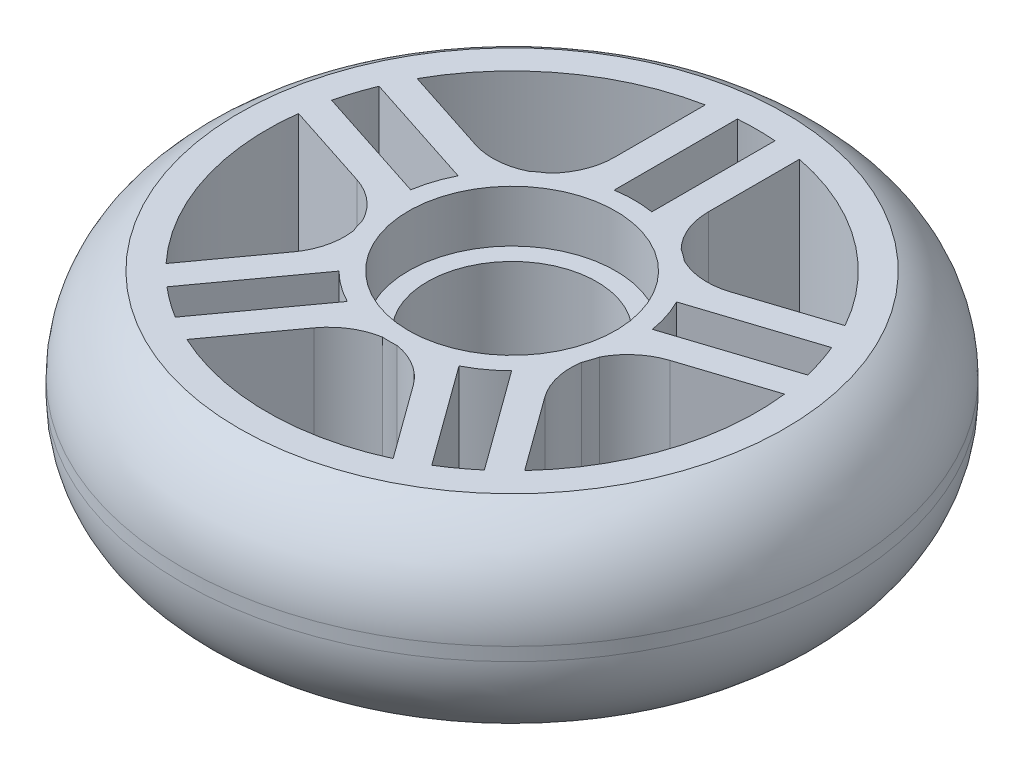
ISO-10303-21;
HEADER;
FILE_DESCRIPTION(('STEP AP214'),'2;1');
FILE_NAME('part.step','',(''),(''),'','','');
FILE_SCHEMA(('AUTOMOTIVE_DESIGN { 1 0 10303 214 1 1 1 1 }'));
ENDSEC;
DATA;
#1=APPLICATION_CONTEXT('core data for automotive mechanical design processes');
#2=APPLICATION_PROTOCOL_DEFINITION('international standard','automotive_design',2000,#1);
#3=PRODUCT_CONTEXT('',#1,'mechanical');
#4=PRODUCT('Part','Part','',(#3));
#5=PRODUCT_RELATED_PRODUCT_CATEGORY('part','',(#4));
#6=PRODUCT_DEFINITION_FORMATION('','',#4);
#7=PRODUCT_DEFINITION_CONTEXT('part definition',#1,'design');
#8=PRODUCT_DEFINITION('design','',#6,#7);
#9=PRODUCT_DEFINITION_SHAPE('','',#8);
#10=(LENGTH_UNIT() NAMED_UNIT(*) SI_UNIT(.MILLI.,.METRE.));
#11=(NAMED_UNIT(*) PLANE_ANGLE_UNIT() SI_UNIT($,.RADIAN.));
#12=(NAMED_UNIT(*) SI_UNIT($,.STERADIAN.) SOLID_ANGLE_UNIT());
#13=UNCERTAINTY_MEASURE_WITH_UNIT(LENGTH_MEASURE(1.E-05),#10,'distance_accuracy_value','');
#14=(GEOMETRIC_REPRESENTATION_CONTEXT(3) GLOBAL_UNCERTAINTY_ASSIGNED_CONTEXT((#13)) GLOBAL_UNIT_ASSIGNED_CONTEXT((#10,
#11,#12)) REPRESENTATION_CONTEXT('',''));
#15=CARTESIAN_POINT('',(0.,0.,0.));
#16=DIRECTION('',(0.,0.,1.));
#17=DIRECTION('',(1.,0.,0.));
#18=AXIS2_PLACEMENT_3D('',#15,#16,#17);
#19=CARTESIAN_POINT('',(0.,-10.5,0.));
#20=DIRECTION('',(0.,1.,0.));
#21=DIRECTION('',(0.,0.,1.));
#22=AXIS2_PLACEMENT_3D('',#19,#20,#21);
#23=CYLINDRICAL_SURFACE('',#22,11.);
#24=CARTESIAN_POINT('',(0.,-10.5,0.));
#25=DIRECTION('',(0.,1.,0.));
#26=DIRECTION('',(0.,0.,1.));
#27=AXIS2_PLACEMENT_3D('',#24,#25,#26);
#28=CIRCLE('',#27,11.);
#29=CARTESIAN_POINT('',(0.,-10.5,11.));
#30=VERTEX_POINT('',#29);
#31=EDGE_CURVE('E373',#30,#30,#28,.T.);
#32=CARTESIAN_POINT('',(0.,-5.,0.));
#33=DIRECTION('',(0.,1.,0.));
#34=DIRECTION('',(0.,0.,1.));
#35=AXIS2_PLACEMENT_3D('',#32,#33,#34);
#36=CIRCLE('',#35,11.);
#37=CARTESIAN_POINT('',(0.,-5.,11.));
#38=VERTEX_POINT('',#37);
#39=EDGE_CURVE('E11',#38,#38,#36,.F.);
#40=CARTESIAN_POINT('',(0.,-10.5,11.));
#41=CARTESIAN_POINT('',(0.,-10.4427083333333,11.));
#42=CARTESIAN_POINT('',(0.,-10.3854166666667,11.));
#43=CARTESIAN_POINT('',(0.,-10.2708333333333,11.));
#44=CARTESIAN_POINT('',(0.,-10.2135416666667,11.));
#45=CARTESIAN_POINT('',(0.,-10.0989583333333,11.));
#46=CARTESIAN_POINT('',(0.,-10.0416666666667,11.));
#47=CARTESIAN_POINT('',(0.,-9.92708333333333,11.));
#48=CARTESIAN_POINT('',(0.,-9.86979166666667,11.));
#49=CARTESIAN_POINT('',(0.,-9.75520833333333,11.));
#50=CARTESIAN_POINT('',(0.,-9.69791666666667,11.));
#51=CARTESIAN_POINT('',(0.,-9.58333333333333,11.));
#52=CARTESIAN_POINT('',(0.,-9.52604166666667,11.));
#53=CARTESIAN_POINT('',(0.,-9.41145833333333,11.));
#54=CARTESIAN_POINT('',(0.,-9.35416666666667,11.));
#55=CARTESIAN_POINT('',(0.,-9.23958333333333,11.));
#56=CARTESIAN_POINT('',(0.,-9.18229166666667,11.));
#57=CARTESIAN_POINT('',(0.,-9.06770833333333,11.));
#58=CARTESIAN_POINT('',(0.,-9.01041666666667,11.));
#59=CARTESIAN_POINT('',(0.,-8.89583333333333,11.));
#60=CARTESIAN_POINT('',(0.,-8.83854166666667,11.));
#61=CARTESIAN_POINT('',(0.,-8.72395833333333,11.));
#62=CARTESIAN_POINT('',(0.,-8.66666666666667,11.));
#63=CARTESIAN_POINT('',(0.,-8.55208333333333,11.));
#64=CARTESIAN_POINT('',(0.,-8.49479166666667,11.));
#65=CARTESIAN_POINT('',(0.,-8.38020833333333,11.));
#66=CARTESIAN_POINT('',(0.,-8.32291666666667,11.));
#67=CARTESIAN_POINT('',(0.,-8.20833333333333,11.));
#68=CARTESIAN_POINT('',(0.,-8.15104166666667,11.));
#69=CARTESIAN_POINT('',(0.,-8.03645833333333,11.));
#70=CARTESIAN_POINT('',(0.,-7.97916666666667,11.));
#71=CARTESIAN_POINT('',(0.,-7.86458333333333,11.));
#72=CARTESIAN_POINT('',(0.,-7.80729166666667,11.));
#73=CARTESIAN_POINT('',(0.,-7.69270833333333,11.));
#74=CARTESIAN_POINT('',(0.,-7.63541666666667,11.));
#75=CARTESIAN_POINT('',(0.,-7.52083333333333,11.));
#76=CARTESIAN_POINT('',(0.,-7.46354166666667,11.));
#77=CARTESIAN_POINT('',(0.,-7.34895833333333,11.));
#78=CARTESIAN_POINT('',(0.,-7.29166666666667,11.));
#79=CARTESIAN_POINT('',(0.,-7.17708333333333,11.));
#80=CARTESIAN_POINT('',(0.,-7.11979166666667,11.));
#81=CARTESIAN_POINT('',(0.,-7.00520833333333,11.));
#82=CARTESIAN_POINT('',(0.,-6.94791666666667,11.));
#83=CARTESIAN_POINT('',(0.,-6.83333333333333,11.));
#84=CARTESIAN_POINT('',(0.,-6.77604166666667,11.));
#85=CARTESIAN_POINT('',(0.,-6.66145833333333,11.));
#86=CARTESIAN_POINT('',(0.,-6.60416666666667,11.));
#87=CARTESIAN_POINT('',(0.,-6.48958333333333,11.));
#88=CARTESIAN_POINT('',(0.,-6.43229166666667,11.));
#89=CARTESIAN_POINT('',(0.,-6.31770833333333,11.));
#90=CARTESIAN_POINT('',(0.,-6.26041666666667,11.));
#91=CARTESIAN_POINT('',(0.,-6.14583333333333,11.));
#92=CARTESIAN_POINT('',(0.,-6.08854166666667,11.));
#93=CARTESIAN_POINT('',(0.,-5.97395833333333,11.));
#94=CARTESIAN_POINT('',(0.,-5.91666666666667,11.));
#95=CARTESIAN_POINT('',(0.,-5.80208333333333,11.));
#96=CARTESIAN_POINT('',(0.,-5.74479166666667,11.));
#97=CARTESIAN_POINT('',(0.,-5.63020833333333,11.));
#98=CARTESIAN_POINT('',(0.,-5.57291666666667,11.));
#99=CARTESIAN_POINT('',(0.,-5.45833333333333,11.));
#100=CARTESIAN_POINT('',(0.,-5.40104166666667,11.));
#101=CARTESIAN_POINT('',(0.,-5.28645833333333,11.));
#102=CARTESIAN_POINT('',(0.,-5.22916666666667,11.));
#103=CARTESIAN_POINT('',(0.,-5.11458333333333,11.));
#104=CARTESIAN_POINT('',(0.,-5.05729166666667,11.));
#105=CARTESIAN_POINT('',(0.,-5.,11.));
#106=B_SPLINE_CURVE_WITH_KNOTS('',3,(#40,#41,#42,#43,#44,#45,#46,#47,#48,#49,#50,#51,#52,#53,
#54,#55,#56,#57,#58,#59,#60,#61,#62,#63,#64,#65,#66,#67,#68,#69,#70,#71,#72,#73,#74,#75,#76,#77,
#78,#79,#80,#81,#82,#83,#84,#85,#86,#87,#88,#89,#90,#91,#92,#93,#94,#95,#96,#97,#98,#99,#100,
#101,#102,#103,#104,#105),.UNSPECIFIED.,.F.,.F.,(4,2,2,2,2,2,2,2,2,2,2,2,2,2,2,2,2,2,2,2,2,2,2,
2,2,2,2,2,2,2,2,2,4),(0.,0.171875,0.34375,0.515625,0.687500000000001,0.859375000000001,1.03125,
1.203125,1.375,1.546875,1.71875,1.890625,2.0625,2.234375,2.40625,2.578125,2.75,2.921875,3.09375,
3.265625,3.4375,3.609375,3.78125,3.953125,4.125,4.296875,4.46875,4.640625,4.8125,4.984375,
5.15625,5.328125,5.5),.UNSPECIFIED.);
#107=EDGE_CURVE('BSEAM41',#30,#38,#106,.T.);
#108=ORIENTED_EDGE('',*,*,#31,.F.);
#109=ORIENTED_EDGE('',*,*,#39,.F.);
#110=ORIENTED_EDGE('',*,*,#107,.T.);
#111=ORIENTED_EDGE('',*,*,#107,.F.);
#112=EDGE_LOOP('',(#108,#110,#109,#111));
#113=FACE_BOUND('',#112,.T.);
#114=ADVANCED_FACE('F41',(#113),#23,.F.);
#115=CARTESIAN_POINT('',(0.,-10.5,0.));
#116=DIRECTION('',(0.,1.,0.));
#117=DIRECTION('',(0.,0.,1.));
#118=AXIS2_PLACEMENT_3D('',#115,#116,#117);
#119=CYLINDRICAL_SURFACE('',#118,35.);
#120=CARTESIAN_POINT('',(0.,-0.702041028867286,0.));
#121=DIRECTION('',(0.,-1.,0.));
#122=DIRECTION('',(0.,0.,-1.));
#123=AXIS2_PLACEMENT_3D('',#120,#121,#122);
#124=CIRCLE('',#123,35.);
#125=CARTESIAN_POINT('',(0.,-0.702041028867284,35.));
#126=VERTEX_POINT('',#125);
#127=EDGE_CURVE('E50',#126,#126,#124,.F.);
#128=CARTESIAN_POINT('',(0.,0.702041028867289,0.));
#129=DIRECTION('',(0.,1.,0.));
#130=DIRECTION('',(0.,0.,1.));
#131=AXIS2_PLACEMENT_3D('',#128,#129,#130);
#132=CIRCLE('',#131,35.);
#133=CARTESIAN_POINT('',(0.,0.702041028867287,35.));
#134=VERTEX_POINT('',#133);
#135=EDGE_CURVE('E823',#134,#134,#132,.F.);
#136=CARTESIAN_POINT('',(0.,-0.702041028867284,35.));
#137=CARTESIAN_POINT('',(0.,-0.687415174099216,35.));
#138=CARTESIAN_POINT('',(0.,-0.672789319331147,35.));
#139=CARTESIAN_POINT('',(0.,-0.64353760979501,35.));
#140=CARTESIAN_POINT('',(0.,-0.628911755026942,35.));
#141=CARTESIAN_POINT('',(0.,-0.599660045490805,35.));
#142=CARTESIAN_POINT('',(0.,-0.585034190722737,35.));
#143=CARTESIAN_POINT('',(0.,-0.5557824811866,35.));
#144=CARTESIAN_POINT('',(0.,-0.541156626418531,35.));
#145=CARTESIAN_POINT('',(0.,-0.511904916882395,35.));
#146=CARTESIAN_POINT('',(0.,-0.497279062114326,35.));
#147=CARTESIAN_POINT('',(0.,-0.468027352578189,35.));
#148=CARTESIAN_POINT('',(0.,-0.453401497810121,35.));
#149=CARTESIAN_POINT('',(0.,-0.424149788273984,35.));
#150=CARTESIAN_POINT('',(0.,-0.409523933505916,35.));
#151=CARTESIAN_POINT('',(0.,-0.380272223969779,35.));
#152=CARTESIAN_POINT('',(0.,-0.36564636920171,35.));
#153=CARTESIAN_POINT('',(0.,-0.336394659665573,35.));
#154=CARTESIAN_POINT('',(0.,-0.321768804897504,35.));
#155=CARTESIAN_POINT('',(0.,-0.292517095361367,35.));
#156=CARTESIAN_POINT('',(0.,-0.277891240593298,35.));
#157=CARTESIAN_POINT('',(0.,-0.248639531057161,35.));
#158=CARTESIAN_POINT('',(0.,-0.234013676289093,35.));
#159=CARTESIAN_POINT('',(0.,-0.204761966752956,35.));
#160=CARTESIAN_POINT('',(0.,-0.190136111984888,35.));
#161=CARTESIAN_POINT('',(0.,-0.160884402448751,35.));
#162=CARTESIAN_POINT('',(0.,-0.146258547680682,35.));
#163=CARTESIAN_POINT('',(0.,-0.117006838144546,35.));
#164=CARTESIAN_POINT('',(0.,-0.102380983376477,35.));
#165=CARTESIAN_POINT('',(0.,-0.0731292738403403,35.));
#166=CARTESIAN_POINT('',(0.,-0.0585034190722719,35.));
#167=CARTESIAN_POINT('',(0.,-0.0292517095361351,35.));
#168=CARTESIAN_POINT('',(0.,-0.0146258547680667,35.));
#169=CARTESIAN_POINT('',(0.,0.0146258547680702,35.));
#170=CARTESIAN_POINT('',(0.,0.0292517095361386,35.));
#171=CARTESIAN_POINT('',(0.,0.0585034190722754,35.));
#172=CARTESIAN_POINT('',(0.,0.0731292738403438,35.));
#173=CARTESIAN_POINT('',(0.,0.102380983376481,35.));
#174=CARTESIAN_POINT('',(0.,0.117006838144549,35.));
#175=CARTESIAN_POINT('',(0.,0.146258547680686,35.));
#176=CARTESIAN_POINT('',(0.,0.160884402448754,35.));
#177=CARTESIAN_POINT('',(0.,0.190136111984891,35.));
#178=CARTESIAN_POINT('',(0.,0.20476196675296,35.));
#179=CARTESIAN_POINT('',(0.,0.234013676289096,35.));
#180=CARTESIAN_POINT('',(0.,0.248639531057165,35.));
#181=CARTESIAN_POINT('',(0.,0.277891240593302,35.));
#182=CARTESIAN_POINT('',(0.,0.292517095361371,35.));
#183=CARTESIAN_POINT('',(0.,0.321768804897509,35.));
#184=CARTESIAN_POINT('',(0.,0.336394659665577,35.));
#185=CARTESIAN_POINT('',(0.,0.365646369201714,35.));
#186=CARTESIAN_POINT('',(0.,0.380272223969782,35.));
#187=CARTESIAN_POINT('',(0.,0.409523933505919,35.));
#188=CARTESIAN_POINT('',(0.,0.424149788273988,35.));
#189=CARTESIAN_POINT('',(0.,0.453401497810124,35.));
#190=CARTESIAN_POINT('',(0.,0.468027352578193,35.));
#191=CARTESIAN_POINT('',(0.,0.49727906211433,35.));
#192=CARTESIAN_POINT('',(0.,0.511904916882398,35.));
#193=CARTESIAN_POINT('',(0.,0.541156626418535,35.));
#194=CARTESIAN_POINT('',(0.,0.555782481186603,35.));
#195=CARTESIAN_POINT('',(0.,0.58503419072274,35.));
#196=CARTESIAN_POINT('',(0.,0.599660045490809,35.));
#197=CARTESIAN_POINT('',(0.,0.628911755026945,35.));
#198=CARTESIAN_POINT('',(0.,0.643537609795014,35.));
#199=CARTESIAN_POINT('',(0.,0.672789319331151,35.));
#200=CARTESIAN_POINT('',(0.,0.687415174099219,35.));
#201=CARTESIAN_POINT('',(0.,0.702041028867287,35.));
#202=B_SPLINE_CURVE_WITH_KNOTS('',3,(#136,#137,#138,#139,#140,#141,#142,#143,#144,#145,#146,
#147,#148,#149,#150,#151,#152,#153,#154,#155,#156,#157,#158,#159,#160,#161,#162,#163,#164,#165,
#166,#167,#168,#169,#170,#171,#172,#173,#174,#175,#176,#177,#178,#179,#180,#181,#182,#183,#184,
#185,#186,#187,#188,#189,#190,#191,#192,#193,#194,#195,#196,#197,#198,#199,#200,#201),
.UNSPECIFIED.,.F.,.F.,(4,2,2,2,2,2,2,2,2,2,2,2,2,2,2,2,2,2,2,2,2,2,2,2,2,2,2,2,2,2,2,2,4),(0.,
0.0438775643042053,0.0877551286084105,0.131632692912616,0.175510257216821,0.219387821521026,
0.263265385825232,0.307142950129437,0.351020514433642,0.394898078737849,0.438775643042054,
0.482653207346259,0.526530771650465,0.57040833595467,0.614285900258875,0.658163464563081,
0.702041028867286,0.745918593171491,0.789796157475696,0.833673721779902,0.877551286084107,
0.921428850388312,0.965306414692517,1.00918397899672,1.05306154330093,1.09693910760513,
1.14081667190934,1.18469423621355,1.22857180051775,1.27244936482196,1.31632692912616,
1.36020449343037,1.40408205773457),.UNSPECIFIED.);
#203=EDGE_CURVE('BSEAM830',#126,#134,#202,.T.);
#204=ORIENTED_EDGE('',*,*,#127,.T.);
#205=ORIENTED_EDGE('',*,*,#135,.T.);
#206=ORIENTED_EDGE('',*,*,#203,.T.);
#207=ORIENTED_EDGE('',*,*,#203,.F.);
#208=EDGE_LOOP('',(#204,#206,#205,#207));
#209=FACE_BOUND('',#208,.T.);
#210=ADVANCED_FACE('F830',(#209),#119,.T.);
#211=CARTESIAN_POINT('',(0.,-0.702041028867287,0.));
#212=DIRECTION('',(0.,-1.,0.));
#213=DIRECTION('',(0.,0.,-1.));
#214=AXIS2_PLACEMENT_3D('',#211,#212,#213);
#215=TOROIDAL_SURFACE('',#214,24.,11.);
#216=CARTESIAN_POINT('',(0.,-10.5,0.));
#217=DIRECTION('',(0.,1.,0.));
#218=DIRECTION('',(0.,0.,1.));
#219=AXIS2_PLACEMENT_3D('',#216,#217,#218);
#220=CIRCLE('',#219,29.);
#221=CARTESIAN_POINT('',(0.,-10.5,29.));
#222=VERTEX_POINT('',#221);
#223=EDGE_CURVE('E668',#222,#222,#220,.T.);
#224=ORIENTED_EDGE('',*,*,#223,.T.);
#225=EDGE_LOOP('',(#224));
#226=FACE_BOUND('',#225,.T.);
#227=ORIENTED_EDGE('',*,*,#127,.F.);
#228=EDGE_LOOP('',(#227));
#229=FACE_BOUND('',#228,.T.);
#230=ADVANCED_FACE('F833',(#226,#229),#215,.T.);
#231=CARTESIAN_POINT('',(0.,0.702041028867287,0.));
#232=DIRECTION('',(0.,1.,0.));
#233=DIRECTION('',(0.,0.,1.));
#234=AXIS2_PLACEMENT_3D('',#231,#232,#233);
#235=TOROIDAL_SURFACE('',#234,24.,11.);
#236=ORIENTED_EDGE('',*,*,#135,.F.);
#237=EDGE_LOOP('',(#236));
#238=FACE_BOUND('',#237,.T.);
#239=CARTESIAN_POINT('',(0.,10.5,0.));
#240=DIRECTION('',(0.,1.,0.));
#241=DIRECTION('',(0.,0.,1.));
#242=AXIS2_PLACEMENT_3D('',#239,#240,#241);
#243=CIRCLE('',#242,29.);
#244=CARTESIAN_POINT('',(0.,10.5,29.));
#245=VERTEX_POINT('',#244);
#246=EDGE_CURVE('E677',#245,#245,#243,.T.);
#247=ORIENTED_EDGE('',*,*,#246,.F.);
#248=EDGE_LOOP('',(#247));
#249=FACE_BOUND('',#248,.T.);
#250=ADVANCED_FACE('F43',(#238,#249),#235,.T.);
#251=CARTESIAN_POINT('',(0.,-10.5,0.));
#252=DIRECTION('',(0.,1.,0.));
#253=DIRECTION('',(0.,0.,1.));
#254=AXIS2_PLACEMENT_3D('',#251,#252,#253);
#255=CYLINDRICAL_SURFACE('',#254,13.);
#256=DIRECTION('',(0.,1.,0.));
#257=VECTOR('',#256,1.);
#258=CARTESIAN_POINT('',(9.16827226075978,-10.5,9.21644094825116));
#259=LINE('',#258,#257);
#260=CARTESIAN_POINT('',(9.16827226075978,-10.5,9.21644094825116));
#261=VERTEX_POINT('',#260);
#262=CARTESIAN_POINT('',(9.16827226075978,10.5,9.21644094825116));
#263=VERTEX_POINT('',#262);
#264=EDGE_CURVE('E683',#261,#263,#259,.T.);
#265=ORIENTED_EDGE('',*,*,#264,.T.);
#266=CARTESIAN_POINT('',(0.,10.5,0.));
#267=DIRECTION('',(0.,1.,0.));
#268=DIRECTION('',(0.,0.,1.));
#269=AXIS2_PLACEMENT_3D('',#266,#267,#268);
#270=CIRCLE('',#269,13.);
#271=CARTESIAN_POINT('',(5.93220428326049,10.5,11.5675819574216));
#272=VERTEX_POINT('',#271);
#273=EDGE_CURVE('E385',#272,#263,#270,.T.);
#274=ORIENTED_EDGE('',*,*,#273,.F.);
#275=DIRECTION('',(0.,1.,0.));
#276=VECTOR('',#275,1.);
#277=CARTESIAN_POINT('',(5.93220428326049,-10.5,11.5675819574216));
#278=LINE('',#277,#276);
#279=CARTESIAN_POINT('',(5.93220428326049,-10.5,11.5675819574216));
#280=VERTEX_POINT('',#279);
#281=EDGE_CURVE('E57',#280,#272,#278,.T.);
#282=ORIENTED_EDGE('',*,*,#281,.F.);
#283=CARTESIAN_POINT('',(0.,-10.5,0.));
#284=DIRECTION('',(0.,1.,0.));
#285=DIRECTION('',(0.,0.,1.));
#286=AXIS2_PLACEMENT_3D('',#283,#284,#285);
#287=CIRCLE('',#286,13.);
#288=EDGE_CURVE('E544',#280,#261,#287,.T.);
#289=ORIENTED_EDGE('',*,*,#288,.T.);
#290=EDGE_LOOP('',(#265,#274,#282,#289));
#291=FACE_BOUND('',#290,.T.);
#292=ADVANCED_FACE('F840',(#291),#255,.T.);
#293=CARTESIAN_POINT('',(-1.61803398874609,-10.5,1.17557050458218));
#294=DIRECTION('',(0.809016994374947,0.,-0.587785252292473));
#295=DIRECTION('',(-0.587785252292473,0.,-0.809016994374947));
#296=AXIS2_PLACEMENT_3D('',#293,#294,#295);
#297=PLANE('',#296);
#298=ORIENTED_EDGE('',*,*,#281,.T.);
#299=DIRECTION('',(-0.587785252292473,0.,-0.809016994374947));
#300=VECTOR('',#299,1.);
#301=CARTESIAN_POINT('',(-1.61803398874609,10.5,1.17557050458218));
#302=LINE('',#301,#300);
#303=CARTESIAN_POINT('',(13.6191012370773,10.5,22.1476879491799));
#304=VERTEX_POINT('',#303);
#305=EDGE_CURVE('E530',#304,#272,#302,.T.);
#306=ORIENTED_EDGE('',*,*,#305,.F.);
#307=DIRECTION('',(0.,1.,0.));
#308=VECTOR('',#307,1.);
#309=CARTESIAN_POINT('',(13.6191012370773,-10.5,22.1476879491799));
#310=LINE('',#309,#308);
#311=CARTESIAN_POINT('',(13.6191012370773,-10.5,22.1476879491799));
#312=VERTEX_POINT('',#311);
#313=EDGE_CURVE('E65',#312,#304,#310,.T.);
#314=ORIENTED_EDGE('',*,*,#313,.F.);
#315=DIRECTION('',(-0.587785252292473,0.,-0.809016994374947));
#316=VECTOR('',#315,1.);
#317=CARTESIAN_POINT('',(-1.61803398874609,-10.5,1.17557050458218));
#318=LINE('',#317,#316);
#319=EDGE_CURVE('E665',#312,#280,#318,.T.);
#320=ORIENTED_EDGE('',*,*,#319,.T.);
#321=EDGE_LOOP('',(#298,#306,#314,#320));
#322=FACE_BOUND('',#321,.T.);
#323=ADVANCED_FACE('F1381',(#322),#297,.T.);
#324=CARTESIAN_POINT('',(0.,-10.5,0.));
#325=DIRECTION('',(0.,1.,0.));
#326=DIRECTION('',(0.,0.,1.));
#327=AXIS2_PLACEMENT_3D('',#324,#325,#326);
#328=CYLINDRICAL_SURFACE('',#327,26.);
#329=ORIENTED_EDGE('',*,*,#313,.T.);
#330=CARTESIAN_POINT('',(0.,10.5,0.));
#331=DIRECTION('',(0.,1.,0.));
#332=DIRECTION('',(0.,0.,1.));
#333=AXIS2_PLACEMENT_3D('',#330,#331,#332);
#334=CIRCLE('',#333,26.);
#335=CARTESIAN_POINT('',(16.8551692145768,10.5,19.7965469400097));
#336=VERTEX_POINT('',#335);
#337=EDGE_CURVE('E412',#304,#336,#334,.T.);
#338=ORIENTED_EDGE('',*,*,#337,.T.);
#339=DIRECTION('',(0.,1.,0.));
#340=VECTOR('',#339,1.);
#341=CARTESIAN_POINT('',(16.8551692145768,-10.5,19.7965469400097));
#342=LINE('',#341,#340);
#343=CARTESIAN_POINT('',(16.8551692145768,-10.5,19.7965469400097));
#344=VERTEX_POINT('',#343);
#345=EDGE_CURVE('E680',#344,#336,#342,.T.);
#346=ORIENTED_EDGE('',*,*,#345,.F.);
#347=CARTESIAN_POINT('',(0.,-10.5,0.));
#348=DIRECTION('',(0.,1.,0.));
#349=DIRECTION('',(0.,0.,1.));
#350=AXIS2_PLACEMENT_3D('',#347,#348,#349);
#351=CIRCLE('',#350,26.);
#352=EDGE_CURVE('E555',#312,#344,#351,.T.);
#353=ORIENTED_EDGE('',*,*,#352,.F.);
#354=EDGE_LOOP('',(#329,#338,#346,#353));
#355=FACE_BOUND('',#354,.T.);
#356=ADVANCED_FACE('F1045',(#355),#328,.F.);
#357=CARTESIAN_POINT('',(19.0266166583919,-10.5,5.77227177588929));
#358=DIRECTION('',(0.,1.,0.));
#359=DIRECTION('',(0.,0.,1.));
#360=AXIS2_PLACEMENT_3D('',#357,#358,#359);
#361=CYLINDRICAL_SURFACE('',#360,7.);
#362=DIRECTION('',(0.,1.,0.));
#363=VECTOR('',#362,1.);
#364=CARTESIAN_POINT('',(12.1019837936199,-10.5,4.74784037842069));
#365=LINE('',#364,#363);
#366=CARTESIAN_POINT('',(12.1019837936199,-10.5,4.74784037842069));
#367=VERTEX_POINT('',#366);
#368=CARTESIAN_POINT('',(12.1019837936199,10.5,4.74784037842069));
#369=VERTEX_POINT('',#368);
#370=EDGE_CURVE('E701',#367,#369,#365,.T.);
#371=ORIENTED_EDGE('',*,*,#370,.T.);
#372=CARTESIAN_POINT('',(19.0266166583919,10.5,5.77227177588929));
#373=DIRECTION('',(0.,1.,0.));
#374=DIRECTION('',(0.,0.,1.));
#375=AXIS2_PLACEMENT_3D('',#372,#373,#374);
#376=CIRCLE('',#375,7.);
#377=CARTESIAN_POINT('',(13.3634976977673,10.5,9.88676854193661));
#378=VERTEX_POINT('',#377);
#379=EDGE_CURVE('E508',#378,#369,#376,.F.);
#380=ORIENTED_EDGE('',*,*,#379,.F.);
#381=DIRECTION('',(0.,1.,0.));
#382=VECTOR('',#381,1.);
#383=CARTESIAN_POINT('',(13.3634976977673,-10.5,9.88676854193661));
#384=LINE('',#383,#382);
#385=CARTESIAN_POINT('',(13.3634976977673,-10.5,9.88676854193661));
#386=VERTEX_POINT('',#385);
#387=EDGE_CURVE('E686',#386,#378,#384,.T.);
#388=ORIENTED_EDGE('',*,*,#387,.F.);
#389=CARTESIAN_POINT('',(19.0266166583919,-10.5,5.77227177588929));
#390=DIRECTION('',(0.,1.,0.));
#391=DIRECTION('',(0.,0.,1.));
#392=AXIS2_PLACEMENT_3D('',#389,#390,#391);
#393=CIRCLE('',#392,7.);
#394=EDGE_CURVE('E645',#386,#367,#393,.F.);
#395=ORIENTED_EDGE('',*,*,#394,.T.);
#396=EDGE_LOOP('',(#371,#380,#388,#395));
#397=FACE_BOUND('',#396,.T.);
#398=ADVANCED_FACE('F1362',(#397),#361,.F.);
#399=CARTESIAN_POINT('',(4.04508497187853,-10.5,-2.93892626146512));
#400=DIRECTION('',(0.809016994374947,0.,-0.587785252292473));
#401=DIRECTION('',(-0.587785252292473,0.,-0.809016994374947));
#402=AXIS2_PLACEMENT_3D('',#399,#400,#401);
#403=PLANE('',#402);
#404=ORIENTED_EDGE('',*,*,#387,.T.);
#405=DIRECTION('',(-0.587785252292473,0.,-0.809016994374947));
#406=VECTOR('',#405,1.);
#407=CARTESIAN_POINT('',(4.04508497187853,10.5,-2.93892626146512));
#408=LINE('',#407,#406);
#409=CARTESIAN_POINT('',(19.0422503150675,10.5,17.7029009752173));
#410=VERTEX_POINT('',#409);
#411=EDGE_CURVE('E522',#410,#378,#408,.T.);
#412=ORIENTED_EDGE('',*,*,#411,.F.);
#413=DIRECTION('',(0.,1.,0.));
#414=VECTOR('',#413,1.);
#415=CARTESIAN_POINT('',(19.0422503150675,-10.5,17.7029009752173));
#416=LINE('',#415,#414);
#417=CARTESIAN_POINT('',(19.0422503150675,-10.5,17.7029009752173));
#418=VERTEX_POINT('',#417);
#419=EDGE_CURVE('E689',#418,#410,#416,.T.);
#420=ORIENTED_EDGE('',*,*,#419,.F.);
#421=DIRECTION('',(-0.587785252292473,0.,-0.809016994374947));
#422=VECTOR('',#421,1.);
#423=CARTESIAN_POINT('',(4.04508497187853,-10.5,-2.93892626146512));
#424=LINE('',#423,#422);
#425=EDGE_CURVE('E658',#418,#386,#424,.T.);
#426=ORIENTED_EDGE('',*,*,#425,.T.);
#427=EDGE_LOOP('',(#404,#412,#420,#426));
#428=FACE_BOUND('',#427,.T.);
#429=ADVANCED_FACE('F1353',(#428),#403,.T.);
#430=ORIENTED_EDGE('',*,*,#419,.T.);
#431=CARTESIAN_POINT('',(25.8110082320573,10.5,-3.12919383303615));
#432=VERTEX_POINT('',#431);
#433=EDGE_CURVE('E521',#410,#432,#334,.T.);
#434=ORIENTED_EDGE('',*,*,#433,.T.);
#435=DIRECTION('',(0.,1.,0.));
#436=VECTOR('',#435,1.);
#437=CARTESIAN_POINT('',(25.8110082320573,-10.5,-3.12919383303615));
#438=LINE('',#437,#436);
#439=CARTESIAN_POINT('',(25.8110082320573,-10.5,-3.12919383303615));
#440=VERTEX_POINT('',#439);
#441=EDGE_CURVE('E692',#440,#432,#438,.T.);
#442=ORIENTED_EDGE('',*,*,#441,.F.);
#443=EDGE_CURVE('E657',#418,#440,#351,.T.);
#444=ORIENTED_EDGE('',*,*,#443,.F.);
#445=EDGE_LOOP('',(#430,#434,#442,#444));
#446=FACE_BOUND('',#445,.T.);
#447=ADVANCED_FACE('F1316',(#446),#328,.F.);
#448=CARTESIAN_POINT('',(1.54508497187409,-10.5,4.75528258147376));
#449=DIRECTION('',(-0.309016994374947,0.,-0.951056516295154));
#450=DIRECTION('',(-0.951056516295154,0.,0.309016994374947));
#451=AXIS2_PLACEMENT_3D('',#448,#449,#450);
#452=PLANE('',#451);
#453=ORIENTED_EDGE('',*,*,#441,.T.);
#454=DIRECTION('',(-0.951056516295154,0.,0.309016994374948));
#455=VECTOR('',#454,1.);
#456=CARTESIAN_POINT('',(1.54508497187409,10.5,4.75528258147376));
#457=LINE('',#456,#455);
#458=CARTESIAN_POINT('',(16.6225934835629,10.5,-0.143696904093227));
#459=VERTEX_POINT('',#458);
#460=EDGE_CURVE('E517',#432,#459,#457,.T.);
#461=ORIENTED_EDGE('',*,*,#460,.T.);
#462=DIRECTION('',(0.,1.,0.));
#463=VECTOR('',#462,1.);
#464=CARTESIAN_POINT('',(16.6225934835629,-10.5,-0.143696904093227));
#465=LINE('',#464,#463);
#466=CARTESIAN_POINT('',(16.6225934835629,-10.5,-0.143696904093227));
#467=VERTEX_POINT('',#466);
#468=EDGE_CURVE('E695',#467,#459,#465,.T.);
#469=ORIENTED_EDGE('',*,*,#468,.F.);
#470=DIRECTION('',(-0.951056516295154,0.,0.309016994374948));
#471=VECTOR('',#470,1.);
#472=CARTESIAN_POINT('',(1.54508497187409,-10.5,4.75528258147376));
#473=LINE('',#472,#471);
#474=EDGE_CURVE('E653',#440,#467,#473,.T.);
#475=ORIENTED_EDGE('',*,*,#474,.F.);
#476=EDGE_LOOP('',(#453,#461,#469,#475));
#477=FACE_BOUND('',#476,.T.);
#478=ADVANCED_FACE('F1334',(#477),#452,.F.);
#479=CARTESIAN_POINT('',(18.7857124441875,-10.5,6.51369870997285));
#480=DIRECTION('',(0.,1.,0.));
#481=DIRECTION('',(0.,0.,1.));
#482=AXIS2_PLACEMENT_3D('',#479,#480,#481);
#483=CYLINDRICAL_SURFACE('',#482,7.);
#484=ORIENTED_EDGE('',*,*,#468,.T.);
#485=CARTESIAN_POINT('',(18.7857124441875,10.5,6.51369870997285));
#486=DIRECTION('',(0.,1.,0.));
#487=DIRECTION('',(0.,0.,1.));
#488=AXIS2_PLACEMENT_3D('',#485,#486,#487);
#489=CIRCLE('',#488,7.);
#490=CARTESIAN_POINT('',(12.5814211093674,10.5,3.27228404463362));
#491=VERTEX_POINT('',#490);
#492=EDGE_CURVE('E513',#459,#491,#489,.T.);
#493=ORIENTED_EDGE('',*,*,#492,.T.);
#494=DIRECTION('',(0.,1.,0.));
#495=VECTOR('',#494,1.);
#496=CARTESIAN_POINT('',(12.5814211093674,-10.5,3.27228404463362));
#497=LINE('',#496,#495);
#498=CARTESIAN_POINT('',(12.5814211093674,-10.5,3.27228404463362));
#499=VERTEX_POINT('',#498);
#500=EDGE_CURVE('E698',#499,#491,#497,.T.);
#501=ORIENTED_EDGE('',*,*,#500,.F.);
#502=CARTESIAN_POINT('',(18.7857124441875,-10.5,6.51369870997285));
#503=DIRECTION('',(0.,1.,0.));
#504=DIRECTION('',(0.,0.,1.));
#505=AXIS2_PLACEMENT_3D('',#502,#503,#504);
#506=CIRCLE('',#505,7.);
#507=EDGE_CURVE('E650',#467,#499,#506,.T.);
#508=ORIENTED_EDGE('',*,*,#507,.F.);
#509=EDGE_LOOP('',(#484,#493,#501,#508));
#510=FACE_BOUND('',#509,.T.);
#511=ADVANCED_FACE('F1324',(#510),#483,.F.);
#512=CARTESIAN_POINT('',(0.618033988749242,-10.5,1.9021130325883));
#513=DIRECTION('',(-0.309016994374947,0.,-0.951056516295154));
#514=DIRECTION('',(-0.951056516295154,0.,0.309016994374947));
#515=AXIS2_PLACEMENT_3D('',#512,#513,#514);
#516=PLANE('',#515);
#517=DIRECTION('',(0.,1.,0.));
#518=VECTOR('',#517,1.);
#519=CARTESIAN_POINT('',(12.8345761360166,-10.5,-2.06728213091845));
#520=LINE('',#519,#518);
#521=CARTESIAN_POINT('',(12.8345761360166,-10.5,-2.06728213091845));
#522=VERTEX_POINT('',#521);
#523=CARTESIAN_POINT('',(12.8345761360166,10.5,-2.06728213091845));
#524=VERTEX_POINT('',#523);
#525=EDGE_CURVE('E713',#522,#524,#520,.T.);
#526=ORIENTED_EDGE('',*,*,#525,.T.);
#527=DIRECTION('',(-0.951056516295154,0.,0.309016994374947));
#528=VECTOR('',#527,1.);
#529=CARTESIAN_POINT('',(0.618033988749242,10.5,1.9021130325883));
#530=LINE('',#529,#528);
#531=CARTESIAN_POINT('',(25.2722366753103,10.5,-6.10852301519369));
#532=VERTEX_POINT('',#531);
#533=EDGE_CURVE('E498',#532,#524,#530,.T.);
#534=ORIENTED_EDGE('',*,*,#533,.F.);
#535=DIRECTION('',(0.,1.,0.));
#536=VECTOR('',#535,1.);
#537=CARTESIAN_POINT('',(25.2722366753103,-10.5,-6.10852301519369));
#538=LINE('',#537,#536);
#539=CARTESIAN_POINT('',(25.2722366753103,-10.5,-6.10852301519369));
#540=VERTEX_POINT('',#539);
#541=EDGE_CURVE('E704',#540,#532,#538,.T.);
#542=ORIENTED_EDGE('',*,*,#541,.F.);
#543=DIRECTION('',(-0.951056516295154,0.,0.309016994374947));
#544=VECTOR('',#543,1.);
#545=CARTESIAN_POINT('',(0.618033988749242,-10.5,1.9021130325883));
#546=LINE('',#545,#544);
#547=EDGE_CURVE('E636',#540,#522,#546,.T.);
#548=ORIENTED_EDGE('',*,*,#547,.T.);
#549=EDGE_LOOP('',(#526,#534,#542,#548));
#550=FACE_BOUND('',#549,.T.);
#551=ADVANCED_FACE('F1314',(#550),#516,.T.);
#552=ORIENTED_EDGE('',*,*,#541,.T.);
#553=CARTESIAN_POINT('',(24.0361686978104,10.5,-9.91274908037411));
#554=VERTEX_POINT('',#553);
#555=EDGE_CURVE('E507',#532,#554,#334,.T.);
#556=ORIENTED_EDGE('',*,*,#555,.T.);
#557=DIRECTION('',(0.,1.,0.));
#558=VECTOR('',#557,1.);
#559=CARTESIAN_POINT('',(24.0361686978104,-10.5,-9.91274908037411));
#560=LINE('',#559,#558);
#561=CARTESIAN_POINT('',(24.0361686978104,-10.5,-9.91274908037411));
#562=VERTEX_POINT('',#561);
#563=EDGE_CURVE('E707',#562,#554,#560,.T.);
#564=ORIENTED_EDGE('',*,*,#563,.F.);
#565=EDGE_CURVE('E644',#540,#562,#351,.T.);
#566=ORIENTED_EDGE('',*,*,#565,.F.);
#567=EDGE_LOOP('',(#552,#556,#564,#566));
#568=FACE_BOUND('',#567,.T.);
#569=ADVANCED_FACE('F1277',(#568),#328,.F.);
#570=CARTESIAN_POINT('',(-0.618033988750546,-10.5,-1.90211303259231));
#571=DIRECTION('',(-0.309016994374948,0.,-0.951056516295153));
#572=DIRECTION('',(-0.951056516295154,0.,0.309016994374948));
#573=AXIS2_PLACEMENT_3D('',#570,#571,#572);
#574=PLANE('',#573);
#575=ORIENTED_EDGE('',*,*,#563,.T.);
#576=DIRECTION('',(-0.951056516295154,0.,0.309016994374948));
#577=VECTOR('',#576,1.);
#578=CARTESIAN_POINT('',(-0.618033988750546,10.5,-1.90211303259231));
#579=LINE('',#578,#577);
#580=CARTESIAN_POINT('',(11.5985081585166,10.5,-5.87150819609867));
#581=VERTEX_POINT('',#580);
#582=EDGE_CURVE('E503',#554,#581,#579,.T.);
#583=ORIENTED_EDGE('',*,*,#582,.T.);
#584=DIRECTION('',(0.,1.,0.));
#585=VECTOR('',#584,1.);
#586=CARTESIAN_POINT('',(11.5985081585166,-10.5,-5.87150819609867));
#587=LINE('',#586,#585);
#588=CARTESIAN_POINT('',(11.5985081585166,-10.5,-5.87150819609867));
#589=VERTEX_POINT('',#588);
#590=EDGE_CURVE('E710',#589,#581,#587,.T.);
#591=ORIENTED_EDGE('',*,*,#590,.F.);
#592=DIRECTION('',(-0.951056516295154,0.,0.309016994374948));
#593=VECTOR('',#592,1.);
#594=CARTESIAN_POINT('',(-0.618033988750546,-10.5,-1.90211303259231));
#595=LINE('',#594,#593);
#596=EDGE_CURVE('E641',#562,#589,#595,.T.);
#597=ORIENTED_EDGE('',*,*,#596,.F.);
#598=EDGE_LOOP('',(#575,#583,#591,#597));
#599=FACE_BOUND('',#598,.T.);
#600=ADVANCED_FACE('F1295',(#599),#574,.F.);
#601=CARTESIAN_POINT('',(11.3693045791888,-10.5,-16.3116576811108));
#602=DIRECTION('',(0.,1.,0.));
#603=DIRECTION('',(0.,0.,1.));
#604=AXIS2_PLACEMENT_3D('',#601,#602,#603);
#605=CYLINDRICAL_SURFACE('',#604,7.);
#606=DIRECTION('',(0.,1.,0.));
#607=VECTOR('',#606,1.);
#608=CARTESIAN_POINT('',(8.25518318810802,-10.5,-10.0425071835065));
#609=LINE('',#608,#607);
#610=CARTESIAN_POINT('',(8.25518318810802,-10.5,-10.0425071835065));
#611=VERTEX_POINT('',#610);
#612=CARTESIAN_POINT('',(8.25518318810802,10.5,-10.0425071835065));
#613=VERTEX_POINT('',#612);
#614=EDGE_CURVE('E731',#611,#613,#609,.T.);
#615=ORIENTED_EDGE('',*,*,#614,.T.);
#616=CARTESIAN_POINT('',(11.3693045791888,10.5,-16.3116576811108));
#617=DIRECTION('',(0.,1.,0.));
#618=DIRECTION('',(0.,0.,1.));
#619=AXIS2_PLACEMENT_3D('',#616,#617,#618);
#620=CIRCLE('',#619,7.);
#621=CARTESIAN_POINT('',(13.5324235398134,10.5,-9.65426206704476));
#622=VERTEX_POINT('',#621);
#623=EDGE_CURVE('E480',#622,#613,#620,.F.);
#624=ORIENTED_EDGE('',*,*,#623,.F.);
#625=DIRECTION('',(0.,1.,0.));
#626=VECTOR('',#625,1.);
#627=CARTESIAN_POINT('',(13.5324235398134,-10.5,-9.65426206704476));
#628=LINE('',#627,#626);
#629=CARTESIAN_POINT('',(13.5324235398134,-10.5,-9.65426206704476));
#630=VERTEX_POINT('',#629);
#631=EDGE_CURVE('E716',#630,#622,#628,.T.);
#632=ORIENTED_EDGE('',*,*,#631,.F.);
#633=CARTESIAN_POINT('',(11.3693045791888,-10.5,-16.3116576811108));
#634=DIRECTION('',(0.,1.,0.));
#635=DIRECTION('',(0.,0.,1.));
#636=AXIS2_PLACEMENT_3D('',#633,#634,#635);
#637=CIRCLE('',#636,7.);
#638=EDGE_CURVE('E619',#630,#611,#637,.F.);
#639=ORIENTED_EDGE('',*,*,#638,.T.);
#640=EDGE_LOOP('',(#615,#624,#632,#639));
#641=FACE_BOUND('',#640,.T.);
#642=ADVANCED_FACE('F1285',(#641),#605,.F.);
#643=CARTESIAN_POINT('',(-1.54508497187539,-10.5,-4.75528258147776));
#644=DIRECTION('',(-0.309016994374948,0.,-0.951056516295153));
#645=DIRECTION('',(-0.951056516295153,0.,0.309016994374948));
#646=AXIS2_PLACEMENT_3D('',#643,#644,#645);
#647=PLANE('',#646);
#648=ORIENTED_EDGE('',*,*,#631,.T.);
#649=DIRECTION('',(-0.951056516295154,0.,0.309016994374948));
#650=VECTOR('',#649,1.);
#651=CARTESIAN_POINT('',(-1.54508497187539,10.5,-4.75528258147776));
#652=LINE('',#651,#650);
#653=CARTESIAN_POINT('',(22.7208382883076,10.5,-12.6397589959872));
#654=VERTEX_POINT('',#653);
#655=EDGE_CURVE('E494',#654,#622,#652,.T.);
#656=ORIENTED_EDGE('',*,*,#655,.F.);
#657=DIRECTION('',(0.,1.,0.));
#658=VECTOR('',#657,1.);
#659=CARTESIAN_POINT('',(22.7208382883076,-10.5,-12.6397589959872));
#660=LINE('',#659,#658);
#661=CARTESIAN_POINT('',(22.7208382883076,-10.5,-12.6397589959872));
#662=VERTEX_POINT('',#661);
#663=EDGE_CURVE('E719',#662,#654,#660,.T.);
#664=ORIENTED_EDGE('',*,*,#663,.F.);
#665=DIRECTION('',(-0.951056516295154,0.,0.309016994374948));
#666=VECTOR('',#665,1.);
#667=CARTESIAN_POINT('',(-1.54508497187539,-10.5,-4.75528258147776));
#668=LINE('',#667,#666);
#669=EDGE_CURVE('E632',#662,#630,#668,.T.);
#670=ORIENTED_EDGE('',*,*,#669,.T.);
#671=EDGE_LOOP('',(#648,#656,#664,#670));
#672=FACE_BOUND('',#671,.T.);
#673=ADVANCED_FACE('F1275',(#672),#647,.T.);
#674=ORIENTED_EDGE('',*,*,#663,.T.);
#675=CARTESIAN_POINT('',(5.,10.5,-25.5147016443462));
#676=VERTEX_POINT('',#675);
#677=EDGE_CURVE('E493',#654,#676,#334,.T.);
#678=ORIENTED_EDGE('',*,*,#677,.T.);
#679=DIRECTION('',(0.,1.,0.));
#680=VECTOR('',#679,1.);
#681=CARTESIAN_POINT('',(5.,-10.5,-25.5147016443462));
#682=LINE('',#681,#680);
#683=CARTESIAN_POINT('',(5.,-10.5,-25.5147016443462));
#684=VERTEX_POINT('',#683);
#685=EDGE_CURVE('E722',#684,#676,#682,.T.);
#686=ORIENTED_EDGE('',*,*,#685,.F.);
#687=EDGE_CURVE('E631',#662,#684,#351,.T.);
#688=ORIENTED_EDGE('',*,*,#687,.F.);
#689=EDGE_LOOP('',(#674,#678,#686,#688));
#690=FACE_BOUND('',#689,.T.);
#691=ADVANCED_FACE('F1238',(#690),#328,.F.);
#692=CARTESIAN_POINT('',(5.,-10.5,0.));
#693=DIRECTION('',(-1.,0.,0.));
#694=DIRECTION('',(0.,0.,1.));
#695=AXIS2_PLACEMENT_3D('',#692,#693,#694);
#696=PLANE('',#695);
#697=ORIENTED_EDGE('',*,*,#685,.T.);
#698=DIRECTION('',(0.,0.,1.));
#699=VECTOR('',#698,1.);
#700=CARTESIAN_POINT('',(5.,10.5,0.));
#701=LINE('',#700,#699);
#702=CARTESIAN_POINT('',(5.,10.5,-15.8534306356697));
#703=VERTEX_POINT('',#702);
#704=EDGE_CURVE('E489',#676,#703,#701,.T.);
#705=ORIENTED_EDGE('',*,*,#704,.T.);
#706=DIRECTION('',(0.,1.,0.));
#707=VECTOR('',#706,1.);
#708=CARTESIAN_POINT('',(5.,-10.5,-15.8534306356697));
#709=LINE('',#708,#707);
#710=CARTESIAN_POINT('',(5.,-10.5,-15.8534306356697));
#711=VERTEX_POINT('',#710);
#712=EDGE_CURVE('E725',#711,#703,#709,.T.);
#713=ORIENTED_EDGE('',*,*,#712,.F.);
#714=DIRECTION('',(0.,0.,1.));
#715=VECTOR('',#714,1.);
#716=CARTESIAN_POINT('',(5.,-10.5,0.));
#717=LINE('',#716,#715);
#718=EDGE_CURVE('E627',#684,#711,#717,.T.);
#719=ORIENTED_EDGE('',*,*,#718,.F.);
#720=EDGE_LOOP('',(#697,#705,#713,#719));
#721=FACE_BOUND('',#720,.T.);
#722=ADVANCED_FACE('F1256',(#721),#696,.F.);
#723=CARTESIAN_POINT('',(12.,-10.5,-15.8534306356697));
#724=DIRECTION('',(0.,1.,0.));
#725=DIRECTION('',(0.,0.,1.));
#726=AXIS2_PLACEMENT_3D('',#723,#724,#725);
#727=CYLINDRICAL_SURFACE('',#726,7.);
#728=ORIENTED_EDGE('',*,*,#712,.T.);
#729=CARTESIAN_POINT('',(12.,10.5,-15.8534306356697));
#730=DIRECTION('',(0.,1.,0.));
#731=DIRECTION('',(0.,0.,1.));
#732=AXIS2_PLACEMENT_3D('',#729,#730,#731);
#733=CIRCLE('',#732,7.);
#734=CARTESIAN_POINT('',(7.,10.5,-10.9544511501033));
#735=VERTEX_POINT('',#734);
#736=EDGE_CURVE('E485',#703,#735,#733,.T.);
#737=ORIENTED_EDGE('',*,*,#736,.T.);
#738=DIRECTION('',(0.,1.,0.));
#739=VECTOR('',#738,1.);
#740=CARTESIAN_POINT('',(7.,-10.5,-10.9544511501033));
#741=LINE('',#740,#739);
#742=CARTESIAN_POINT('',(7.,-10.5,-10.9544511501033));
#743=VERTEX_POINT('',#742);
#744=EDGE_CURVE('E728',#743,#735,#741,.T.);
#745=ORIENTED_EDGE('',*,*,#744,.F.);
#746=CARTESIAN_POINT('',(12.,-10.5,-15.8534306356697));
#747=DIRECTION('',(0.,1.,0.));
#748=DIRECTION('',(0.,0.,1.));
#749=AXIS2_PLACEMENT_3D('',#746,#747,#748);
#750=CIRCLE('',#749,7.);
#751=EDGE_CURVE('E624',#711,#743,#750,.T.);
#752=ORIENTED_EDGE('',*,*,#751,.F.);
#753=EDGE_LOOP('',(#728,#737,#745,#752));
#754=FACE_BOUND('',#753,.T.);
#755=ADVANCED_FACE('F1246',(#754),#727,.F.);
#756=CARTESIAN_POINT('',(2.,-10.5,0.));
#757=DIRECTION('',(-1.,0.,0.));
#758=DIRECTION('',(0.,0.,1.));
#759=AXIS2_PLACEMENT_3D('',#756,#757,#758);
#760=PLANE('',#759);
#761=DIRECTION('',(0.,1.,0.));
#762=VECTOR('',#761,1.);
#763=CARTESIAN_POINT('',(2.,-10.5,-12.8452325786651));
#764=LINE('',#763,#762);
#765=CARTESIAN_POINT('',(2.,-10.5,-12.8452325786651));
#766=VERTEX_POINT('',#765);
#767=CARTESIAN_POINT('',(2.,10.5,-12.8452325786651));
#768=VERTEX_POINT('',#767);
#769=EDGE_CURVE('E743',#766,#768,#764,.T.);
#770=ORIENTED_EDGE('',*,*,#769,.T.);
#771=DIRECTION('',(0.,0.,1.));
#772=VECTOR('',#771,1.);
#773=CARTESIAN_POINT('',(2.,10.5,0.));
#774=LINE('',#773,#772);
#775=CARTESIAN_POINT('',(2.,10.5,-25.9229627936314));
#776=VERTEX_POINT('',#775);
#777=EDGE_CURVE('E470',#776,#768,#774,.T.);
#778=ORIENTED_EDGE('',*,*,#777,.F.);
#779=DIRECTION('',(0.,1.,0.));
#780=VECTOR('',#779,1.);
#781=CARTESIAN_POINT('',(2.,-10.5,-25.9229627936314));
#782=LINE('',#781,#780);
#783=CARTESIAN_POINT('',(2.,-10.5,-25.9229627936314));
#784=VERTEX_POINT('',#783);
#785=EDGE_CURVE('E734',#784,#776,#782,.T.);
#786=ORIENTED_EDGE('',*,*,#785,.F.);
#787=DIRECTION('',(0.,0.,1.));
#788=VECTOR('',#787,1.);
#789=CARTESIAN_POINT('',(2.,-10.5,0.));
#790=LINE('',#789,#788);
#791=EDGE_CURVE('E610',#784,#766,#790,.T.);
#792=ORIENTED_EDGE('',*,*,#791,.T.);
#793=EDGE_LOOP('',(#770,#778,#786,#792));
#794=FACE_BOUND('',#793,.T.);
#795=ADVANCED_FACE('F1236',(#794),#760,.T.);
#796=ORIENTED_EDGE('',*,*,#785,.T.);
#797=CARTESIAN_POINT('',(-2.,10.5,-25.9229627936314));
#798=VERTEX_POINT('',#797);
#799=EDGE_CURVE('E479',#776,#798,#334,.T.);
#800=ORIENTED_EDGE('',*,*,#799,.T.);
#801=DIRECTION('',(0.,1.,0.));
#802=VECTOR('',#801,1.);
#803=CARTESIAN_POINT('',(-2.,-10.5,-25.9229627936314));
#804=LINE('',#803,#802);
#805=CARTESIAN_POINT('',(-2.,-10.5,-25.9229627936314));
#806=VERTEX_POINT('',#805);
#807=EDGE_CURVE('E737',#806,#798,#804,.T.);
#808=ORIENTED_EDGE('',*,*,#807,.F.);
#809=EDGE_CURVE('E618',#784,#806,#351,.T.);
#810=ORIENTED_EDGE('',*,*,#809,.F.);
#811=EDGE_LOOP('',(#796,#800,#808,#810));
#812=FACE_BOUND('',#811,.T.);
#813=ADVANCED_FACE('F1199',(#812),#328,.F.);
#814=CARTESIAN_POINT('',(-2.,-10.5,0.));
#815=DIRECTION('',(-1.,0.,0.));
#816=DIRECTION('',(0.,0.,1.));
#817=AXIS2_PLACEMENT_3D('',#814,#815,#816);
#818=PLANE('',#817);
#819=ORIENTED_EDGE('',*,*,#807,.T.);
#820=DIRECTION('',(0.,0.,1.));
#821=VECTOR('',#820,1.);
#822=CARTESIAN_POINT('',(-2.,10.5,0.));
#823=LINE('',#822,#821);
#824=CARTESIAN_POINT('',(-2.,10.5,-12.8452325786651));
#825=VERTEX_POINT('',#824);
#826=EDGE_CURVE('E475',#798,#825,#823,.T.);
#827=ORIENTED_EDGE('',*,*,#826,.T.);
#828=DIRECTION('',(0.,1.,0.));
#829=VECTOR('',#828,1.);
#830=CARTESIAN_POINT('',(-2.,-10.5,-12.8452325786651));
#831=LINE('',#830,#829);
#832=CARTESIAN_POINT('',(-2.,-10.5,-12.8452325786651));
#833=VERTEX_POINT('',#832);
#834=EDGE_CURVE('E740',#833,#825,#831,.T.);
#835=ORIENTED_EDGE('',*,*,#834,.F.);
#836=DIRECTION('',(0.,0.,1.));
#837=VECTOR('',#836,1.);
#838=CARTESIAN_POINT('',(-2.,-10.5,0.));
#839=LINE('',#838,#837);
#840=EDGE_CURVE('E615',#806,#833,#839,.T.);
#841=ORIENTED_EDGE('',*,*,#840,.F.);
#842=EDGE_LOOP('',(#819,#827,#835,#841));
#843=FACE_BOUND('',#842,.T.);
#844=ADVANCED_FACE('F1217',(#843),#818,.F.);
#845=CARTESIAN_POINT('',(-12.,-10.5,-15.8534306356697));
#846=DIRECTION('',(0.,1.,0.));
#847=DIRECTION('',(0.,0.,1.));
#848=AXIS2_PLACEMENT_3D('',#845,#846,#847);
#849=CYLINDRICAL_SURFACE('',#848,7.);
#850=DIRECTION('',(0.,1.,0.));
#851=VECTOR('',#850,1.);
#852=CARTESIAN_POINT('',(-7.,-10.5,-10.9544511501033));
#853=LINE('',#852,#851);
#854=CARTESIAN_POINT('',(-7.,-10.5,-10.9544511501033));
#855=VERTEX_POINT('',#854);
#856=CARTESIAN_POINT('',(-7.,10.5,-10.9544511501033));
#857=VERTEX_POINT('',#856);
#858=EDGE_CURVE('E761',#855,#857,#853,.T.);
#859=ORIENTED_EDGE('',*,*,#858,.T.);
#860=CARTESIAN_POINT('',(-12.,10.5,-15.8534306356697));
#861=DIRECTION('',(0.,1.,0.));
#862=DIRECTION('',(0.,0.,1.));
#863=AXIS2_PLACEMENT_3D('',#860,#861,#862);
#864=CIRCLE('',#863,7.);
#865=CARTESIAN_POINT('',(-5.,10.5,-15.8534306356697));
#866=VERTEX_POINT('',#865);
#867=EDGE_CURVE('E452',#866,#857,#864,.F.);
#868=ORIENTED_EDGE('',*,*,#867,.F.);
#869=DIRECTION('',(0.,1.,0.));
#870=VECTOR('',#869,1.);
#871=CARTESIAN_POINT('',(-5.,-10.5,-15.8534306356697));
#872=LINE('',#871,#870);
#873=CARTESIAN_POINT('',(-5.,-10.5,-15.8534306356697));
#874=VERTEX_POINT('',#873);
#875=EDGE_CURVE('E746',#874,#866,#872,.T.);
#876=ORIENTED_EDGE('',*,*,#875,.F.);
#877=CARTESIAN_POINT('',(-12.,-10.5,-15.8534306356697));
#878=DIRECTION('',(0.,1.,0.));
#879=DIRECTION('',(0.,0.,1.));
#880=AXIS2_PLACEMENT_3D('',#877,#878,#879);
#881=CIRCLE('',#880,7.);
#882=EDGE_CURVE('E593',#874,#855,#881,.F.);
#883=ORIENTED_EDGE('',*,*,#882,.T.);
#884=EDGE_LOOP('',(#859,#868,#876,#883));
#885=FACE_BOUND('',#884,.T.);
#886=ADVANCED_FACE('F1207',(#885),#849,.F.);
#887=CARTESIAN_POINT('',(-5.,-10.5,0.));
#888=DIRECTION('',(-1.,0.,0.));
#889=DIRECTION('',(0.,0.,1.));
#890=AXIS2_PLACEMENT_3D('',#887,#888,#889);
#891=PLANE('',#890);
#892=ORIENTED_EDGE('',*,*,#875,.T.);
#893=DIRECTION('',(0.,0.,1.));
#894=VECTOR('',#893,1.);
#895=CARTESIAN_POINT('',(-5.,10.5,0.));
#896=LINE('',#895,#894);
#897=CARTESIAN_POINT('',(-5.,10.5,-25.5147016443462));
#898=VERTEX_POINT('',#897);
#899=EDGE_CURVE('E466',#898,#866,#896,.T.);
#900=ORIENTED_EDGE('',*,*,#899,.F.);
#901=DIRECTION('',(0.,1.,0.));
#902=VECTOR('',#901,1.);
#903=CARTESIAN_POINT('',(-5.,-10.5,-25.5147016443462));
#904=LINE('',#903,#902);
#905=CARTESIAN_POINT('',(-5.,-10.5,-25.5147016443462));
#906=VERTEX_POINT('',#905);
#907=EDGE_CURVE('E749',#906,#898,#904,.T.);
#908=ORIENTED_EDGE('',*,*,#907,.F.);
#909=DIRECTION('',(0.,0.,1.));
#910=VECTOR('',#909,1.);
#911=CARTESIAN_POINT('',(-5.,-10.5,0.));
#912=LINE('',#911,#910);
#913=EDGE_CURVE('E606',#906,#874,#912,.T.);
#914=ORIENTED_EDGE('',*,*,#913,.T.);
#915=EDGE_LOOP('',(#892,#900,#908,#914));
#916=FACE_BOUND('',#915,.T.);
#917=ADVANCED_FACE('F1197',(#916),#891,.T.);
#918=ORIENTED_EDGE('',*,*,#907,.T.);
#919=CARTESIAN_POINT('',(-22.7208382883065,10.5,-12.6397589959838));
#920=VERTEX_POINT('',#919);
#921=EDGE_CURVE('E465',#898,#920,#334,.T.);
#922=ORIENTED_EDGE('',*,*,#921,.T.);
#923=DIRECTION('',(0.,1.,0.));
#924=VECTOR('',#923,1.);
#925=CARTESIAN_POINT('',(-22.7208382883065,-10.5,-12.6397589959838));
#926=LINE('',#925,#924);
#927=CARTESIAN_POINT('',(-22.7208382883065,-10.5,-12.6397589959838));
#928=VERTEX_POINT('',#927);
#929=EDGE_CURVE('E752',#928,#920,#926,.T.);
#930=ORIENTED_EDGE('',*,*,#929,.F.);
#931=EDGE_CURVE('E605',#906,#928,#351,.T.);
#932=ORIENTED_EDGE('',*,*,#931,.F.);
#933=EDGE_LOOP('',(#918,#922,#930,#932));
#934=FACE_BOUND('',#933,.T.);
#935=ADVANCED_FACE('F1160',(#934),#328,.F.);
#936=CARTESIAN_POINT('',(1.54508497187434,-10.5,-4.75528258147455));
#937=DIRECTION('',(-0.309016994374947,0.,0.951056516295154));
#938=DIRECTION('',(0.951056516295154,0.,0.309016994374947));
#939=AXIS2_PLACEMENT_3D('',#936,#937,#938);
#940=PLANE('',#939);
#941=ORIENTED_EDGE('',*,*,#929,.T.);
#942=DIRECTION('',(0.951056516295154,0.,0.309016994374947));
#943=VECTOR('',#942,1.);
#944=CARTESIAN_POINT('',(1.54508497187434,10.5,-4.75528258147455));
#945=LINE('',#944,#943);
#946=CARTESIAN_POINT('',(-13.53242353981,10.5,-9.65426206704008));
#947=VERTEX_POINT('',#946);
#948=EDGE_CURVE('E461',#920,#947,#945,.T.);
#949=ORIENTED_EDGE('',*,*,#948,.T.);
#950=DIRECTION('',(0.,1.,0.));
#951=VECTOR('',#950,1.);
#952=CARTESIAN_POINT('',(-13.53242353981,-10.5,-9.65426206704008));
#953=LINE('',#952,#951);
#954=CARTESIAN_POINT('',(-13.53242353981,-10.5,-9.65426206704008));
#955=VERTEX_POINT('',#954);
#956=EDGE_CURVE('E755',#955,#947,#953,.T.);
#957=ORIENTED_EDGE('',*,*,#956,.F.);
#958=DIRECTION('',(0.951056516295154,0.,0.309016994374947));
#959=VECTOR('',#958,1.);
#960=CARTESIAN_POINT('',(1.54508497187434,-10.5,-4.75528258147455));
#961=LINE('',#960,#959);
#962=EDGE_CURVE('E601',#928,#955,#961,.T.);
#963=ORIENTED_EDGE('',*,*,#962,.F.);
#964=EDGE_LOOP('',(#941,#949,#957,#963));
#965=FACE_BOUND('',#964,.T.);
#966=ADVANCED_FACE('F1178',(#965),#940,.F.);
#967=CARTESIAN_POINT('',(-11.3693045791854,-10.5,-16.3116576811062));
#968=DIRECTION('',(0.,1.,0.));
#969=DIRECTION('',(0.,0.,1.));
#970=AXIS2_PLACEMENT_3D('',#967,#968,#969);
#971=CYLINDRICAL_SURFACE('',#970,7.);
#972=ORIENTED_EDGE('',*,*,#956,.T.);
#973=CARTESIAN_POINT('',(-11.3693045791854,10.5,-16.3116576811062));
#974=DIRECTION('',(0.,1.,0.));
#975=DIRECTION('',(0.,0.,1.));
#976=AXIS2_PLACEMENT_3D('',#973,#974,#975);
#977=CIRCLE('',#976,7.);
#978=CARTESIAN_POINT('',(-8.25518318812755,10.5,-10.0425071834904));
#979=VERTEX_POINT('',#978);
#980=EDGE_CURVE('E457',#947,#979,#977,.T.);
#981=ORIENTED_EDGE('',*,*,#980,.T.);
#982=DIRECTION('',(0.,1.,0.));
#983=VECTOR('',#982,1.);
#984=CARTESIAN_POINT('',(-8.25518318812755,-10.5,-10.0425071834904));
#985=LINE('',#984,#983);
#986=CARTESIAN_POINT('',(-8.25518318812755,-10.5,-10.0425071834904));
#987=VERTEX_POINT('',#986);
#988=EDGE_CURVE('E758',#987,#979,#985,.T.);
#989=ORIENTED_EDGE('',*,*,#988,.F.);
#990=CARTESIAN_POINT('',(-11.3693045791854,-10.5,-16.3116576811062));
#991=DIRECTION('',(0.,1.,0.));
#992=DIRECTION('',(0.,0.,1.));
#993=AXIS2_PLACEMENT_3D('',#990,#991,#992);
#994=CIRCLE('',#993,7.);
#995=EDGE_CURVE('E598',#955,#987,#994,.T.);
#996=ORIENTED_EDGE('',*,*,#995,.F.);
#997=EDGE_LOOP('',(#972,#981,#989,#996));
#998=FACE_BOUND('',#997,.T.);
#999=ADVANCED_FACE('F1168',(#998),#971,.F.);
#1000=CARTESIAN_POINT('',(0.618033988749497,-10.5,-1.90211303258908));
#1001=DIRECTION('',(-0.309016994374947,0.,0.951056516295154));
#1002=DIRECTION('',(0.951056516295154,0.,0.309016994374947));
#1003=AXIS2_PLACEMENT_3D('',#1000,#1001,#1002);
#1004=PLANE('',#1003);
#1005=DIRECTION('',(0.,1.,0.));
#1006=VECTOR('',#1005,1.);
#1007=CARTESIAN_POINT('',(-11.5985081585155,-10.5,-5.87150819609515));
#1008=LINE('',#1007,#1006);
#1009=CARTESIAN_POINT('',(-11.5985081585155,-10.5,-5.87150819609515));
#1010=VERTEX_POINT('',#1009);
#1011=CARTESIAN_POINT('',(-11.5985081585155,10.5,-5.87150819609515));
#1012=VERTEX_POINT('',#1011);
#1013=EDGE_CURVE('E773',#1010,#1012,#1008,.T.);
#1014=ORIENTED_EDGE('',*,*,#1013,.T.);
#1015=DIRECTION('',(0.951056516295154,0.,0.309016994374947));
#1016=VECTOR('',#1015,1.);
#1017=CARTESIAN_POINT('',(0.618033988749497,10.5,-1.90211303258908));
#1018=LINE('',#1017,#1016);
#1019=CARTESIAN_POINT('',(-24.0361686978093,10.5,-9.91274908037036));
#1020=VERTEX_POINT('',#1019);
#1021=EDGE_CURVE('E442',#1020,#1012,#1018,.T.);
#1022=ORIENTED_EDGE('',*,*,#1021,.F.);
#1023=DIRECTION('',(0.,1.,0.));
#1024=VECTOR('',#1023,1.);
#1025=CARTESIAN_POINT('',(-24.0361686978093,-10.5,-9.91274908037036));
#1026=LINE('',#1025,#1024);
#1027=CARTESIAN_POINT('',(-24.0361686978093,-10.5,-9.91274908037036));
#1028=VERTEX_POINT('',#1027);
#1029=EDGE_CURVE('E764',#1028,#1020,#1026,.T.);
#1030=ORIENTED_EDGE('',*,*,#1029,.F.);
#1031=DIRECTION('',(0.951056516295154,0.,0.309016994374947));
#1032=VECTOR('',#1031,1.);
#1033=CARTESIAN_POINT('',(0.618033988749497,-10.5,-1.90211303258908));
#1034=LINE('',#1033,#1032);
#1035=EDGE_CURVE('E584',#1028,#1010,#1034,.T.);
#1036=ORIENTED_EDGE('',*,*,#1035,.T.);
#1037=EDGE_LOOP('',(#1014,#1022,#1030,#1036));
#1038=FACE_BOUND('',#1037,.T.);
#1039=ADVANCED_FACE('F1158',(#1038),#1004,.T.);
#1040=ORIENTED_EDGE('',*,*,#1029,.T.);
#1041=CARTESIAN_POINT('',(-25.272236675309,10.5,-6.10852301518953));
#1042=VERTEX_POINT('',#1041);
#1043=EDGE_CURVE('E451',#1020,#1042,#334,.T.);
#1044=ORIENTED_EDGE('',*,*,#1043,.T.);
#1045=DIRECTION('',(0.,1.,0.));
#1046=VECTOR('',#1045,1.);
#1047=CARTESIAN_POINT('',(-25.272236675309,-10.5,-6.10852301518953));
#1048=LINE('',#1047,#1046);
#1049=CARTESIAN_POINT('',(-25.272236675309,-10.5,-6.10852301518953));
#1050=VERTEX_POINT('',#1049);
#1051=EDGE_CURVE('E767',#1050,#1042,#1048,.T.);
#1052=ORIENTED_EDGE('',*,*,#1051,.F.);
#1053=EDGE_CURVE('E592',#1028,#1050,#351,.T.);
#1054=ORIENTED_EDGE('',*,*,#1053,.F.);
#1055=EDGE_LOOP('',(#1040,#1044,#1052,#1054));
#1056=FACE_BOUND('',#1055,.T.);
#1057=ADVANCED_FACE('F1121',(#1056),#328,.F.);
#1058=CARTESIAN_POINT('',(-0.61803398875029,-10.5,1.90211303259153));
#1059=DIRECTION('',(-0.309016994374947,0.,0.951056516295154));
#1060=DIRECTION('',(0.951056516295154,0.,0.309016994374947));
#1061=AXIS2_PLACEMENT_3D('',#1058,#1059,#1060);
#1062=PLANE('',#1061);
#1063=ORIENTED_EDGE('',*,*,#1051,.T.);
#1064=DIRECTION('',(0.951056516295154,0.,0.309016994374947));
#1065=VECTOR('',#1064,1.);
#1066=CARTESIAN_POINT('',(-0.61803398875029,10.5,1.90211303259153));
#1067=LINE('',#1066,#1065);
#1068=CARTESIAN_POINT('',(-12.8345761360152,10.5,-2.0672821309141));
#1069=VERTEX_POINT('',#1068);
#1070=EDGE_CURVE('E447',#1042,#1069,#1067,.T.);
#1071=ORIENTED_EDGE('',*,*,#1070,.T.);
#1072=DIRECTION('',(0.,1.,0.));
#1073=VECTOR('',#1072,1.);
#1074=CARTESIAN_POINT('',(-12.8345761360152,-10.5,-2.0672821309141));
#1075=LINE('',#1074,#1073);
#1076=CARTESIAN_POINT('',(-12.8345761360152,-10.5,-2.0672821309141));
#1077=VERTEX_POINT('',#1076);
#1078=EDGE_CURVE('E770',#1077,#1069,#1075,.T.);
#1079=ORIENTED_EDGE('',*,*,#1078,.F.);
#1080=DIRECTION('',(0.951056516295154,0.,0.309016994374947));
#1081=VECTOR('',#1080,1.);
#1082=CARTESIAN_POINT('',(-0.61803398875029,-10.5,1.90211303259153));
#1083=LINE('',#1082,#1081);
#1084=EDGE_CURVE('E589',#1050,#1077,#1083,.T.);
#1085=ORIENTED_EDGE('',*,*,#1084,.F.);
#1086=EDGE_LOOP('',(#1063,#1071,#1079,#1085));
#1087=FACE_BOUND('',#1086,.T.);
#1088=ADVANCED_FACE('F1139',(#1087),#1062,.F.);
#1089=CARTESIAN_POINT('',(-18.7857124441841,-10.5,6.51369870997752));
#1090=DIRECTION('',(0.,1.,0.));
#1091=DIRECTION('',(0.,0.,1.));
#1092=AXIS2_PLACEMENT_3D('',#1089,#1090,#1091);
#1093=CYLINDRICAL_SURFACE('',#1092,7.);
#1094=DIRECTION('',(0.,1.,0.));
#1095=VECTOR('',#1094,1.);
#1096=CARTESIAN_POINT('',(-12.5814211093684,-10.5,3.27228404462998));
#1097=LINE('',#1096,#1095);
#1098=CARTESIAN_POINT('',(-12.5814211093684,-10.5,3.27228404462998));
#1099=VERTEX_POINT('',#1098);
#1100=CARTESIAN_POINT('',(-12.5814211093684,10.5,3.27228404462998));
#1101=VERTEX_POINT('',#1100);
#1102=EDGE_CURVE('E791',#1099,#1101,#1097,.T.);
#1103=ORIENTED_EDGE('',*,*,#1102,.T.);
#1104=CARTESIAN_POINT('',(-18.7857124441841,10.5,6.51369870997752));
#1105=DIRECTION('',(0.,1.,0.));
#1106=DIRECTION('',(0.,0.,1.));
#1107=AXIS2_PLACEMENT_3D('',#1104,#1105,#1106);
#1108=CIRCLE('',#1107,7.);
#1109=CARTESIAN_POINT('',(-16.6225934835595,10.5,-0.143696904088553));
#1110=VERTEX_POINT('',#1109);
#1111=EDGE_CURVE('E424',#1110,#1101,#1108,.F.);
#1112=ORIENTED_EDGE('',*,*,#1111,.F.);
#1113=DIRECTION('',(0.,1.,0.));
#1114=VECTOR('',#1113,1.);
#1115=CARTESIAN_POINT('',(-16.6225934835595,-10.5,-0.143696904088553));
#1116=LINE('',#1115,#1114);
#1117=CARTESIAN_POINT('',(-16.6225934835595,-10.5,-0.143696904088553));
#1118=VERTEX_POINT('',#1117);
#1119=EDGE_CURVE('E776',#1118,#1110,#1116,.T.);
#1120=ORIENTED_EDGE('',*,*,#1119,.F.);
#1121=CARTESIAN_POINT('',(-18.7857124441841,-10.5,6.51369870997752));
#1122=DIRECTION('',(0.,1.,0.));
#1123=DIRECTION('',(0.,0.,1.));
#1124=AXIS2_PLACEMENT_3D('',#1121,#1122,#1123);
#1125=CIRCLE('',#1124,7.);
#1126=EDGE_CURVE('E567',#1118,#1099,#1125,.F.);
#1127=ORIENTED_EDGE('',*,*,#1126,.T.);
#1128=EDGE_LOOP('',(#1103,#1112,#1120,#1127));
#1129=FACE_BOUND('',#1128,.T.);
#1130=ADVANCED_FACE('F1129',(#1129),#1093,.F.);
#1131=CARTESIAN_POINT('',(-1.54508497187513,-10.5,4.75528258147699));
#1132=DIRECTION('',(-0.309016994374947,0.,0.951056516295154));
#1133=DIRECTION('',(0.951056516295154,0.,0.309016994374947));
#1134=AXIS2_PLACEMENT_3D('',#1131,#1132,#1133);
#1135=PLANE('',#1134);
#1136=ORIENTED_EDGE('',*,*,#1119,.T.);
#1137=DIRECTION('',(0.951056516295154,0.,0.309016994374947));
#1138=VECTOR('',#1137,1.);
#1139=CARTESIAN_POINT('',(-1.54508497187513,10.5,4.75528258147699));
#1140=LINE('',#1139,#1138);
#1141=CARTESIAN_POINT('',(-25.8110082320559,10.5,-3.12919383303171));
#1142=VERTEX_POINT('',#1141);
#1143=EDGE_CURVE('E438',#1142,#1110,#1140,.T.);
#1144=ORIENTED_EDGE('',*,*,#1143,.F.);
#1145=DIRECTION('',(0.,1.,0.));
#1146=VECTOR('',#1145,1.);
#1147=CARTESIAN_POINT('',(-25.8110082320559,-10.5,-3.12919383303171));
#1148=LINE('',#1147,#1146);
#1149=CARTESIAN_POINT('',(-25.8110082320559,-10.5,-3.12919383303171));
#1150=VERTEX_POINT('',#1149);
#1151=EDGE_CURVE('E779',#1150,#1142,#1148,.T.);
#1152=ORIENTED_EDGE('',*,*,#1151,.F.);
#1153=DIRECTION('',(0.951056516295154,0.,0.309016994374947));
#1154=VECTOR('',#1153,1.);
#1155=CARTESIAN_POINT('',(-1.54508497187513,-10.5,4.75528258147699));
#1156=LINE('',#1155,#1154);
#1157=EDGE_CURVE('E580',#1150,#1118,#1156,.T.);
#1158=ORIENTED_EDGE('',*,*,#1157,.T.);
#1159=EDGE_LOOP('',(#1136,#1144,#1152,#1158));
#1160=FACE_BOUND('',#1159,.T.);
#1161=ADVANCED_FACE('F1119',(#1160),#1135,.T.);
#1162=ORIENTED_EDGE('',*,*,#1151,.T.);
#1163=CARTESIAN_POINT('',(-19.0422503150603,10.5,17.7029009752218));
#1164=VERTEX_POINT('',#1163);
#1165=EDGE_CURVE('E437',#1142,#1164,#334,.T.);
#1166=ORIENTED_EDGE('',*,*,#1165,.T.);
#1167=DIRECTION('',(0.,1.,0.));
#1168=VECTOR('',#1167,1.);
#1169=CARTESIAN_POINT('',(-19.0422503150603,-10.5,17.7029009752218));
#1170=LINE('',#1169,#1168);
#1171=CARTESIAN_POINT('',(-19.0422503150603,-10.5,17.7029009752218));
#1172=VERTEX_POINT('',#1171);
#1173=EDGE_CURVE('E782',#1172,#1164,#1170,.T.);
#1174=ORIENTED_EDGE('',*,*,#1173,.F.);
#1175=EDGE_CURVE('E579',#1150,#1172,#351,.T.);
#1176=ORIENTED_EDGE('',*,*,#1175,.F.);
#1177=EDGE_LOOP('',(#1162,#1166,#1174,#1176));
#1178=FACE_BOUND('',#1177,.T.);
#1179=ADVANCED_FACE('F1082',(#1178),#328,.F.);
#1180=CARTESIAN_POINT('',(-4.04508497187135,-10.5,-2.9389262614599));
#1181=DIRECTION('',(0.809016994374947,0.,0.587785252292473));
#1182=DIRECTION('',(0.587785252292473,0.,-0.809016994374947));
#1183=AXIS2_PLACEMENT_3D('',#1180,#1181,#1182);
#1184=PLANE('',#1183);
#1185=ORIENTED_EDGE('',*,*,#1173,.T.);
#1186=DIRECTION('',(0.587785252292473,0.,-0.809016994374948));
#1187=VECTOR('',#1186,1.);
#1188=CARTESIAN_POINT('',(-4.04508497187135,10.5,-2.9389262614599));
#1189=LINE('',#1188,#1187);
#1190=CARTESIAN_POINT('',(-13.3634976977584,10.5,9.8867685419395));
#1191=VERTEX_POINT('',#1190);
#1192=EDGE_CURVE('E433',#1164,#1191,#1189,.T.);
#1193=ORIENTED_EDGE('',*,*,#1192,.T.);
#1194=DIRECTION('',(0.,1.,0.));
#1195=VECTOR('',#1194,1.);
#1196=CARTESIAN_POINT('',(-13.3634976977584,-10.5,9.8867685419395));
#1197=LINE('',#1196,#1195);
#1198=CARTESIAN_POINT('',(-13.3634976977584,-10.5,9.8867685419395));
#1199=VERTEX_POINT('',#1198);
#1200=EDGE_CURVE('E785',#1199,#1191,#1197,.T.);
#1201=ORIENTED_EDGE('',*,*,#1200,.F.);
#1202=DIRECTION('',(0.587785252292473,0.,-0.809016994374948));
#1203=VECTOR('',#1202,1.);
#1204=CARTESIAN_POINT('',(-4.04508497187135,-10.5,-2.9389262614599));
#1205=LINE('',#1204,#1203);
#1206=EDGE_CURVE('E575',#1172,#1199,#1205,.T.);
#1207=ORIENTED_EDGE('',*,*,#1206,.F.);
#1208=EDGE_LOOP('',(#1185,#1193,#1201,#1207));
#1209=FACE_BOUND('',#1208,.T.);
#1210=ADVANCED_FACE('F1100',(#1209),#1184,.F.);
#1211=CARTESIAN_POINT('',(-19.026616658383,-10.5,5.77227177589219));
#1212=DIRECTION('',(0.,1.,0.));
#1213=DIRECTION('',(0.,0.,1.));
#1214=AXIS2_PLACEMENT_3D('',#1211,#1212,#1213);
#1215=CYLINDRICAL_SURFACE('',#1214,7.);
#1216=ORIENTED_EDGE('',*,*,#1200,.T.);
#1217=CARTESIAN_POINT('',(-19.026616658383,10.5,5.77227177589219));
#1218=DIRECTION('',(0.,1.,0.));
#1219=DIRECTION('',(0.,0.,1.));
#1220=AXIS2_PLACEMENT_3D('',#1217,#1218,#1219);
#1221=CIRCLE('',#1220,7.);
#1222=CARTESIAN_POINT('',(-12.1019837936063,10.5,4.74784037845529));
#1223=VERTEX_POINT('',#1222);
#1224=EDGE_CURVE('E429',#1191,#1223,#1221,.T.);
#1225=ORIENTED_EDGE('',*,*,#1224,.T.);
#1226=DIRECTION('',(0.,1.,0.));
#1227=VECTOR('',#1226,1.);
#1228=CARTESIAN_POINT('',(-12.1019837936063,-10.5,4.74784037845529));
#1229=LINE('',#1228,#1227);
#1230=CARTESIAN_POINT('',(-12.1019837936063,-10.5,4.74784037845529));
#1231=VERTEX_POINT('',#1230);
#1232=EDGE_CURVE('E788',#1231,#1223,#1229,.T.);
#1233=ORIENTED_EDGE('',*,*,#1232,.F.);
#1234=CARTESIAN_POINT('',(-19.026616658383,-10.5,5.77227177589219));
#1235=DIRECTION('',(0.,1.,0.));
#1236=DIRECTION('',(0.,0.,1.));
#1237=AXIS2_PLACEMENT_3D('',#1234,#1235,#1236);
#1238=CIRCLE('',#1237,7.);
#1239=EDGE_CURVE('E572',#1199,#1231,#1238,.T.);
#1240=ORIENTED_EDGE('',*,*,#1239,.F.);
#1241=EDGE_LOOP('',(#1216,#1225,#1233,#1240));
#1242=FACE_BOUND('',#1241,.T.);
#1243=ADVANCED_FACE('F1090',(#1242),#1215,.F.);
#1244=CARTESIAN_POINT('',(-1.61803398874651,-10.5,-1.17557050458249));
#1245=DIRECTION('',(0.809016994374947,0.,0.587785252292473));
#1246=DIRECTION('',(0.587785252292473,0.,-0.809016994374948));
#1247=AXIS2_PLACEMENT_3D('',#1244,#1245,#1246);
#1248=PLANE('',#1247);
#1249=DIRECTION('',(0.,1.,0.));
#1250=VECTOR('',#1249,1.);
#1251=CARTESIAN_POINT('',(-9.16827226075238,-10.5,9.21644094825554));
#1252=LINE('',#1251,#1250);
#1253=CARTESIAN_POINT('',(-9.16827226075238,-10.5,9.21644094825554));
#1254=VERTEX_POINT('',#1253);
#1255=CARTESIAN_POINT('',(-9.16827226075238,10.5,9.21644094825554));
#1256=VERTEX_POINT('',#1255);
#1257=EDGE_CURVE('E803',#1254,#1256,#1252,.T.);
#1258=ORIENTED_EDGE('',*,*,#1257,.T.);
#1259=DIRECTION('',(0.587785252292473,0.,-0.809016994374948));
#1260=VECTOR('',#1259,1.);
#1261=CARTESIAN_POINT('',(-1.61803398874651,10.5,-1.17557050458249));
#1262=LINE('',#1261,#1260);
#1263=CARTESIAN_POINT('',(-16.8551692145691,10.5,19.796546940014));
#1264=VERTEX_POINT('',#1263);
#1265=EDGE_CURVE('E416',#1264,#1256,#1262,.T.);
#1266=ORIENTED_EDGE('',*,*,#1265,.F.);
#1267=DIRECTION('',(0.,1.,0.));
#1268=VECTOR('',#1267,1.);
#1269=CARTESIAN_POINT('',(-16.8551692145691,-10.5,19.796546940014));
#1270=LINE('',#1269,#1268);
#1271=CARTESIAN_POINT('',(-16.8551692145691,-10.5,19.796546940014));
#1272=VERTEX_POINT('',#1271);
#1273=EDGE_CURVE('E794',#1272,#1264,#1270,.T.);
#1274=ORIENTED_EDGE('',*,*,#1273,.F.);
#1275=DIRECTION('',(0.587785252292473,0.,-0.809016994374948));
#1276=VECTOR('',#1275,1.);
#1277=CARTESIAN_POINT('',(-1.61803398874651,-10.5,-1.17557050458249));
#1278=LINE('',#1277,#1276);
#1279=EDGE_CURVE('E560',#1272,#1254,#1278,.T.);
#1280=ORIENTED_EDGE('',*,*,#1279,.T.);
#1281=EDGE_LOOP('',(#1258,#1266,#1274,#1280));
#1282=FACE_BOUND('',#1281,.T.);
#1283=ADVANCED_FACE('F1080',(#1282),#1248,.T.);
#1284=ORIENTED_EDGE('',*,*,#1273,.T.);
#1285=CARTESIAN_POINT('',(-13.619101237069,10.5,22.1476879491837));
#1286=VERTEX_POINT('',#1285);
#1287=EDGE_CURVE('E413',#1264,#1286,#334,.T.);
#1288=ORIENTED_EDGE('',*,*,#1287,.T.);
#1289=DIRECTION('',(0.,1.,0.));
#1290=VECTOR('',#1289,1.);
#1291=CARTESIAN_POINT('',(-13.619101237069,-10.5,22.1476879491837));
#1292=LINE('',#1291,#1290);
#1293=CARTESIAN_POINT('',(-13.619101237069,-10.5,22.1476879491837));
#1294=VERTEX_POINT('',#1293);
#1295=EDGE_CURVE('E797',#1294,#1286,#1292,.T.);
#1296=ORIENTED_EDGE('',*,*,#1295,.F.);
#1297=EDGE_CURVE('E556',#1272,#1294,#351,.T.);
#1298=ORIENTED_EDGE('',*,*,#1297,.F.);
#1299=EDGE_LOOP('',(#1284,#1288,#1296,#1298));
#1300=FACE_BOUND('',#1299,.T.);
#1301=ADVANCED_FACE('F1044',(#1300),#328,.F.);
#1302=CARTESIAN_POINT('',(1.61803398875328,-10.5,1.1755705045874));
#1303=DIRECTION('',(0.809016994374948,0.,0.587785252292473));
#1304=DIRECTION('',(0.587785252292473,0.,-0.809016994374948));
#1305=AXIS2_PLACEMENT_3D('',#1302,#1303,#1304);
#1306=PLANE('',#1305);
#1307=ORIENTED_EDGE('',*,*,#1295,.T.);
#1308=DIRECTION('',(0.587785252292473,0.,-0.809016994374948));
#1309=VECTOR('',#1308,1.);
#1310=CARTESIAN_POINT('',(1.61803398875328,10.5,1.1755705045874));
#1311=LINE('',#1310,#1309);
#1312=CARTESIAN_POINT('',(-5.93220428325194,10.5,11.5675819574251));
#1313=VERTEX_POINT('',#1312);
#1314=EDGE_CURVE('E420',#1286,#1313,#1311,.T.);
#1315=ORIENTED_EDGE('',*,*,#1314,.T.);
#1316=DIRECTION('',(0.,1.,0.));
#1317=VECTOR('',#1316,1.);
#1318=CARTESIAN_POINT('',(-5.93220428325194,-10.5,11.5675819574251));
#1319=LINE('',#1318,#1317);
#1320=CARTESIAN_POINT('',(-5.93220428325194,-10.5,11.5675819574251));
#1321=VERTEX_POINT('',#1320);
#1322=EDGE_CURVE('E800',#1321,#1313,#1319,.T.);
#1323=ORIENTED_EDGE('',*,*,#1322,.F.);
#1324=DIRECTION('',(0.587785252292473,0.,-0.809016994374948));
#1325=VECTOR('',#1324,1.);
#1326=CARTESIAN_POINT('',(1.61803398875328,-10.5,1.1755705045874));
#1327=LINE('',#1326,#1325);
#1328=EDGE_CURVE('E564',#1294,#1321,#1327,.T.);
#1329=ORIENTED_EDGE('',*,*,#1328,.F.);
#1330=EDGE_LOOP('',(#1307,#1315,#1323,#1329));
#1331=FACE_BOUND('',#1330,.T.);
#1332=ADVANCED_FACE('F1062',(#1331),#1306,.F.);
#1333=CARTESIAN_POINT('',(0.389791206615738,-10.5,19.8791178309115));
#1334=DIRECTION('',(0.,1.,0.));
#1335=DIRECTION('',(0.,0.,1.));
#1336=AXIS2_PLACEMENT_3D('',#1333,#1334,#1335);
#1337=CYLINDRICAL_SURFACE('',#1336,7.);
#1338=DIRECTION('',(0.,1.,0.));
#1339=VECTOR('',#1338,1.);
#1340=CARTESIAN_POINT('',(-0.775745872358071,-10.5,12.9768339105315));
#1341=LINE('',#1340,#1339);
#1342=CARTESIAN_POINT('',(-0.775745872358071,-10.5,12.9768339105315));
#1343=VERTEX_POINT('',#1342);
#1344=CARTESIAN_POINT('',(-0.775745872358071,10.5,12.9768339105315));
#1345=VERTEX_POINT('',#1344);
#1346=EDGE_CURVE('E361',#1343,#1345,#1341,.T.);
#1347=ORIENTED_EDGE('',*,*,#1346,.T.);
#1348=CARTESIAN_POINT('',(0.389791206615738,10.5,19.8791178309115));
#1349=DIRECTION('',(0.,1.,0.));
#1350=DIRECTION('',(0.,0.,1.));
#1351=AXIS2_PLACEMENT_3D('',#1348,#1349,#1350);
#1352=CIRCLE('',#1351,7.);
#1353=CARTESIAN_POINT('',(-5.2733277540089,10.5,15.7646210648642));
#1354=VERTEX_POINT('',#1353);
#1355=EDGE_CURVE('E365',#1354,#1345,#1352,.F.);
#1356=ORIENTED_EDGE('',*,*,#1355,.F.);
#1357=DIRECTION('',(0.,1.,0.));
#1358=VECTOR('',#1357,1.);
#1359=CARTESIAN_POINT('',(-5.2733277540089,-10.5,15.7646210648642));
#1360=LINE('',#1359,#1358);
#1361=CARTESIAN_POINT('',(-5.2733277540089,-10.5,15.7646210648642));
#1362=VERTEX_POINT('',#1361);
#1363=EDGE_CURVE('E806',#1362,#1354,#1360,.T.);
#1364=ORIENTED_EDGE('',*,*,#1363,.F.);
#1365=CARTESIAN_POINT('',(0.389791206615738,-10.5,19.8791178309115));
#1366=DIRECTION('',(0.,1.,0.));
#1367=DIRECTION('',(0.,0.,1.));
#1368=AXIS2_PLACEMENT_3D('',#1365,#1366,#1367);
#1369=CIRCLE('',#1368,7.);
#1370=EDGE_CURVE('E367',#1362,#1343,#1369,.F.);
#1371=ORIENTED_EDGE('',*,*,#1370,.T.);
#1372=EDGE_LOOP('',(#1347,#1356,#1364,#1371));
#1373=FACE_BOUND('',#1372,.T.);
#1374=ADVANCED_FACE('F363',(#1373),#1337,.F.);
#1375=CARTESIAN_POINT('',(4.04508497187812,-10.5,2.93892626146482));
#1376=DIRECTION('',(0.809016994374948,0.,0.587785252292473));
#1377=DIRECTION('',(0.587785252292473,0.,-0.809016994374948));
#1378=AXIS2_PLACEMENT_3D('',#1375,#1376,#1377);
#1379=PLANE('',#1378);
#1380=ORIENTED_EDGE('',*,*,#1363,.T.);
#1381=DIRECTION('',(0.587785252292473,0.,-0.809016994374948));
#1382=VECTOR('',#1381,1.);
#1383=CARTESIAN_POINT('',(4.04508497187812,10.5,2.93892626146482));
#1384=LINE('',#1383,#1382);
#1385=CARTESIAN_POINT('',(-10.95208037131,10.5,23.5807534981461));
#1386=VERTEX_POINT('',#1385);
#1387=EDGE_CURVE('E392',#1386,#1354,#1384,.T.);
#1388=ORIENTED_EDGE('',*,*,#1387,.F.);
#1389=DIRECTION('',(0.,1.,0.));
#1390=VECTOR('',#1389,1.);
#1391=CARTESIAN_POINT('',(-10.95208037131,-10.5,23.5807534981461));
#1392=LINE('',#1391,#1390);
#1393=CARTESIAN_POINT('',(-10.95208037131,-10.5,23.5807534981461));
#1394=VERTEX_POINT('',#1393);
#1395=EDGE_CURVE('E809',#1394,#1386,#1392,.T.);
#1396=ORIENTED_EDGE('',*,*,#1395,.F.);
#1397=DIRECTION('',(0.587785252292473,0.,-0.809016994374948));
#1398=VECTOR('',#1397,1.);
#1399=CARTESIAN_POINT('',(4.04508497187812,-10.5,2.93892626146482));
#1400=LINE('',#1399,#1398);
#1401=EDGE_CURVE('E554',#1394,#1362,#1400,.T.);
#1402=ORIENTED_EDGE('',*,*,#1401,.T.);
#1403=EDGE_LOOP('',(#1380,#1388,#1396,#1402));
#1404=FACE_BOUND('',#1403,.T.);
#1405=ADVANCED_FACE('F1041',(#1404),#1379,.T.);
#1406=ORIENTED_EDGE('',*,*,#1395,.T.);
#1407=CARTESIAN_POINT('',(10.9520803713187,10.5,23.5807534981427));
#1408=VERTEX_POINT('',#1407);
#1409=EDGE_CURVE('E408',#1386,#1408,#334,.T.);
#1410=ORIENTED_EDGE('',*,*,#1409,.T.);
#1411=DIRECTION('',(0.,1.,0.));
#1412=VECTOR('',#1411,1.);
#1413=CARTESIAN_POINT('',(10.9520803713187,-10.5,23.5807534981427));
#1414=LINE('',#1413,#1412);
#1415=CARTESIAN_POINT('',(10.9520803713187,-10.5,23.5807534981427));
#1416=VERTEX_POINT('',#1415);
#1417=EDGE_CURVE('E812',#1416,#1408,#1414,.T.);
#1418=ORIENTED_EDGE('',*,*,#1417,.F.);
#1419=EDGE_CURVE('E551',#1394,#1416,#351,.T.);
#1420=ORIENTED_EDGE('',*,*,#1419,.F.);
#1421=EDGE_LOOP('',(#1406,#1410,#1418,#1420));
#1422=FACE_BOUND('',#1421,.T.);
#1423=ADVANCED_FACE('F1031',(#1422),#328,.F.);
#1424=CARTESIAN_POINT('',(-4.04508497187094,-10.5,2.9389262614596));
#1425=DIRECTION('',(0.809016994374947,0.,-0.587785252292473));
#1426=DIRECTION('',(-0.587785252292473,0.,-0.809016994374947));
#1427=AXIS2_PLACEMENT_3D('',#1424,#1425,#1426);
#1428=PLANE('',#1427);
#1429=ORIENTED_EDGE('',*,*,#1417,.T.);
#1430=DIRECTION('',(-0.587785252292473,0.,-0.809016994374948));
#1431=VECTOR('',#1430,1.);
#1432=CARTESIAN_POINT('',(-4.04508497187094,10.5,2.9389262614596));
#1433=LINE('',#1432,#1431);
#1434=CARTESIAN_POINT('',(5.27332775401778,10.5,15.7646210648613));
#1435=VERTEX_POINT('',#1434);
#1436=EDGE_CURVE('E404',#1408,#1435,#1433,.T.);
#1437=ORIENTED_EDGE('',*,*,#1436,.T.);
#1438=DIRECTION('',(0.,1.,0.));
#1439=VECTOR('',#1438,1.);
#1440=CARTESIAN_POINT('',(5.27332775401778,-10.5,15.7646210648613));
#1441=LINE('',#1440,#1439);
#1442=CARTESIAN_POINT('',(5.27332775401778,-10.5,15.7646210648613));
#1443=VERTEX_POINT('',#1442);
#1444=EDGE_CURVE('E815',#1443,#1435,#1441,.T.);
#1445=ORIENTED_EDGE('',*,*,#1444,.F.);
#1446=DIRECTION('',(-0.587785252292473,0.,-0.809016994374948));
#1447=VECTOR('',#1446,1.);
#1448=CARTESIAN_POINT('',(-4.04508497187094,-10.5,2.9389262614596));
#1449=LINE('',#1448,#1447);
#1450=EDGE_CURVE('E548',#1416,#1443,#1449,.T.);
#1451=ORIENTED_EDGE('',*,*,#1450,.F.);
#1452=EDGE_LOOP('',(#1429,#1437,#1445,#1451));
#1453=FACE_BOUND('',#1452,.T.);
#1454=ADVANCED_FACE('F1021',(#1453),#1428,.F.);
#1455=CARTESIAN_POINT('',(-0.389791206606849,-10.5,19.8791178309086));
#1456=DIRECTION('',(0.,1.,0.));
#1457=DIRECTION('',(0.,0.,1.));
#1458=AXIS2_PLACEMENT_3D('',#1455,#1456,#1457);
#1459=CYLINDRICAL_SURFACE('',#1458,7.);
#1460=ORIENTED_EDGE('',*,*,#1444,.T.);
#1461=CARTESIAN_POINT('',(-0.389791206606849,10.5,19.8791178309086));
#1462=DIRECTION('',(0.,1.,0.));
#1463=DIRECTION('',(0.,0.,1.));
#1464=AXIS2_PLACEMENT_3D('',#1461,#1462,#1463);
#1465=CIRCLE('',#1464,7.);
#1466=CARTESIAN_POINT('',(0.775745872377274,10.5,12.9768339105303));
#1467=VERTEX_POINT('',#1466);
#1468=EDGE_CURVE('E383',#1435,#1467,#1465,.T.);
#1469=ORIENTED_EDGE('',*,*,#1468,.T.);
#1470=DIRECTION('',(0.,1.,0.));
#1471=VECTOR('',#1470,1.);
#1472=CARTESIAN_POINT('',(0.775745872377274,-10.5,12.9768339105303));
#1473=LINE('',#1472,#1471);
#1474=CARTESIAN_POINT('',(0.775745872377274,-10.5,12.9768339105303));
#1475=VERTEX_POINT('',#1474);
#1476=EDGE_CURVE('E372',#1475,#1467,#1473,.T.);
#1477=ORIENTED_EDGE('',*,*,#1476,.F.);
#1478=CARTESIAN_POINT('',(-0.389791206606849,-10.5,19.8791178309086));
#1479=DIRECTION('',(0.,1.,0.));
#1480=DIRECTION('',(0.,0.,1.));
#1481=AXIS2_PLACEMENT_3D('',#1478,#1479,#1480);
#1482=CIRCLE('',#1481,7.);
#1483=EDGE_CURVE('E543',#1443,#1475,#1482,.T.);
#1484=ORIENTED_EDGE('',*,*,#1483,.F.);
#1485=EDGE_LOOP('',(#1460,#1469,#1477,#1484));
#1486=FACE_BOUND('',#1485,.T.);
#1487=ADVANCED_FACE('F1011',(#1486),#1459,.F.);
#1488=CARTESIAN_POINT('',(1.61803398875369,-10.5,-1.17557050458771));
#1489=DIRECTION('',(0.809016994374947,0.,-0.587785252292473));
#1490=DIRECTION('',(-0.587785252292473,0.,-0.809016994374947));
#1491=AXIS2_PLACEMENT_3D('',#1488,#1489,#1490);
#1492=PLANE('',#1491);
#1493=ORIENTED_EDGE('',*,*,#345,.T.);
#1494=DIRECTION('',(-0.587785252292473,0.,-0.809016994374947));
#1495=VECTOR('',#1494,1.);
#1496=CARTESIAN_POINT('',(1.61803398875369,10.5,-1.17557050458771));
#1497=LINE('',#1496,#1495);
#1498=EDGE_CURVE('E526',#336,#263,#1497,.T.);
#1499=ORIENTED_EDGE('',*,*,#1498,.T.);
#1500=ORIENTED_EDGE('',*,*,#264,.F.);
#1501=DIRECTION('',(-0.587785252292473,0.,-0.809016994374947));
#1502=VECTOR('',#1501,1.);
#1503=CARTESIAN_POINT('',(1.61803398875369,-10.5,-1.17557050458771));
#1504=LINE('',#1503,#1502);
#1505=EDGE_CURVE('E662',#344,#261,#1504,.T.);
#1506=ORIENTED_EDGE('',*,*,#1505,.F.);
#1507=EDGE_LOOP('',(#1493,#1499,#1500,#1506));
#1508=FACE_BOUND('',#1507,.T.);
#1509=ADVANCED_FACE('F1002',(#1508),#1492,.F.);
#1510=ORIENTED_EDGE('',*,*,#500,.T.);
#1511=EDGE_CURVE('E512',#369,#491,#270,.T.);
#1512=ORIENTED_EDGE('',*,*,#1511,.F.);
#1513=ORIENTED_EDGE('',*,*,#370,.F.);
#1514=EDGE_CURVE('E649',#367,#499,#287,.T.);
#1515=ORIENTED_EDGE('',*,*,#1514,.T.);
#1516=EDGE_LOOP('',(#1510,#1512,#1513,#1515));
#1517=FACE_BOUND('',#1516,.T.);
#1518=ADVANCED_FACE('F993',(#1517),#255,.T.);
#1519=ORIENTED_EDGE('',*,*,#590,.T.);
#1520=EDGE_CURVE('E502',#524,#581,#270,.T.);
#1521=ORIENTED_EDGE('',*,*,#1520,.F.);
#1522=ORIENTED_EDGE('',*,*,#525,.F.);
#1523=EDGE_CURVE('E640',#522,#589,#287,.T.);
#1524=ORIENTED_EDGE('',*,*,#1523,.T.);
#1525=EDGE_LOOP('',(#1519,#1521,#1522,#1524));
#1526=FACE_BOUND('',#1525,.T.);
#1527=ADVANCED_FACE('F984',(#1526),#255,.T.);
#1528=ORIENTED_EDGE('',*,*,#744,.T.);
#1529=EDGE_CURVE('E484',#613,#735,#270,.T.);
#1530=ORIENTED_EDGE('',*,*,#1529,.F.);
#1531=ORIENTED_EDGE('',*,*,#614,.F.);
#1532=EDGE_CURVE('E623',#611,#743,#287,.T.);
#1533=ORIENTED_EDGE('',*,*,#1532,.T.);
#1534=EDGE_LOOP('',(#1528,#1530,#1531,#1533));
#1535=FACE_BOUND('',#1534,.T.);
#1536=ADVANCED_FACE('F975',(#1535),#255,.T.);
#1537=ORIENTED_EDGE('',*,*,#834,.T.);
#1538=EDGE_CURVE('E474',#768,#825,#270,.T.);
#1539=ORIENTED_EDGE('',*,*,#1538,.F.);
#1540=ORIENTED_EDGE('',*,*,#769,.F.);
#1541=EDGE_CURVE('E614',#766,#833,#287,.T.);
#1542=ORIENTED_EDGE('',*,*,#1541,.T.);
#1543=EDGE_LOOP('',(#1537,#1539,#1540,#1542));
#1544=FACE_BOUND('',#1543,.T.);
#1545=ADVANCED_FACE('F966',(#1544),#255,.T.);
#1546=ORIENTED_EDGE('',*,*,#988,.T.);
#1547=EDGE_CURVE('E456',#857,#979,#270,.T.);
#1548=ORIENTED_EDGE('',*,*,#1547,.F.);
#1549=ORIENTED_EDGE('',*,*,#858,.F.);
#1550=EDGE_CURVE('E597',#855,#987,#287,.T.);
#1551=ORIENTED_EDGE('',*,*,#1550,.T.);
#1552=EDGE_LOOP('',(#1546,#1548,#1549,#1551));
#1553=FACE_BOUND('',#1552,.T.);
#1554=ADVANCED_FACE('F957',(#1553),#255,.T.);
#1555=ORIENTED_EDGE('',*,*,#1078,.T.);
#1556=EDGE_CURVE('E446',#1012,#1069,#270,.T.);
#1557=ORIENTED_EDGE('',*,*,#1556,.F.);
#1558=ORIENTED_EDGE('',*,*,#1013,.F.);
#1559=EDGE_CURVE('E588',#1010,#1077,#287,.T.);
#1560=ORIENTED_EDGE('',*,*,#1559,.T.);
#1561=EDGE_LOOP('',(#1555,#1557,#1558,#1560));
#1562=FACE_BOUND('',#1561,.T.);
#1563=ADVANCED_FACE('F948',(#1562),#255,.T.);
#1564=ORIENTED_EDGE('',*,*,#1232,.T.);
#1565=EDGE_CURVE('E428',#1101,#1223,#270,.T.);
#1566=ORIENTED_EDGE('',*,*,#1565,.F.);
#1567=ORIENTED_EDGE('',*,*,#1102,.F.);
#1568=EDGE_CURVE('E571',#1099,#1231,#287,.T.);
#1569=ORIENTED_EDGE('',*,*,#1568,.T.);
#1570=EDGE_LOOP('',(#1564,#1566,#1567,#1569));
#1571=FACE_BOUND('',#1570,.T.);
#1572=ADVANCED_FACE('F939',(#1571),#255,.T.);
#1573=ORIENTED_EDGE('',*,*,#1322,.T.);
#1574=EDGE_CURVE('E386',#1256,#1313,#270,.T.);
#1575=ORIENTED_EDGE('',*,*,#1574,.F.);
#1576=ORIENTED_EDGE('',*,*,#1257,.F.);
#1577=EDGE_CURVE('E545',#1254,#1321,#287,.T.);
#1578=ORIENTED_EDGE('',*,*,#1577,.T.);
#1579=EDGE_LOOP('',(#1573,#1575,#1576,#1578));
#1580=FACE_BOUND('',#1579,.T.);
#1581=ADVANCED_FACE('F861',(#1580),#255,.T.);
#1582=ORIENTED_EDGE('',*,*,#1476,.T.);
#1583=EDGE_CURVE('E376',#1345,#1467,#270,.T.);
#1584=ORIENTED_EDGE('',*,*,#1583,.F.);
#1585=ORIENTED_EDGE('',*,*,#1346,.F.);
#1586=EDGE_CURVE('E540',#1343,#1475,#287,.T.);
#1587=ORIENTED_EDGE('',*,*,#1586,.T.);
#1588=EDGE_LOOP('',(#1582,#1584,#1585,#1587));
#1589=FACE_BOUND('',#1588,.T.);
#1590=ADVANCED_FACE('F377',(#1589),#255,.T.);
#1591=CARTESIAN_POINT('',(0.,5.,0.));
#1592=DIRECTION('',(0.,1.,0.));
#1593=DIRECTION('',(0.,0.,1.));
#1594=AXIS2_PLACEMENT_3D('',#1591,#1592,#1593);
#1595=CIRCLE('',#1594,11.);
#1596=CARTESIAN_POINT('',(0.,5.,11.));
#1597=VERTEX_POINT('',#1596);
#1598=EDGE_CURVE('E398',#1597,#1597,#1595,.T.);
#1599=CARTESIAN_POINT('',(0.,10.5,0.));
#1600=DIRECTION('',(0.,1.,0.));
#1601=DIRECTION('',(0.,0.,1.));
#1602=AXIS2_PLACEMENT_3D('',#1599,#1600,#1601);
#1603=CIRCLE('',#1602,11.);
#1604=CARTESIAN_POINT('',(0.,10.5,11.));
#1605=VERTEX_POINT('',#1604);
#1606=EDGE_CURVE('E534',#1605,#1605,#1603,.T.);
#1607=CARTESIAN_POINT('',(0.,5.,11.));
#1608=CARTESIAN_POINT('',(0.,5.05729166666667,11.));
#1609=CARTESIAN_POINT('',(0.,5.11458333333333,11.));
#1610=CARTESIAN_POINT('',(0.,5.22916666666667,11.));
#1611=CARTESIAN_POINT('',(0.,5.28645833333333,11.));
#1612=CARTESIAN_POINT('',(0.,5.40104166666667,11.));
#1613=CARTESIAN_POINT('',(0.,5.45833333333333,11.));
#1614=CARTESIAN_POINT('',(0.,5.57291666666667,11.));
#1615=CARTESIAN_POINT('',(0.,5.63020833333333,11.));
#1616=CARTESIAN_POINT('',(0.,5.74479166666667,11.));
#1617=CARTESIAN_POINT('',(0.,5.80208333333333,11.));
#1618=CARTESIAN_POINT('',(0.,5.91666666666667,11.));
#1619=CARTESIAN_POINT('',(0.,5.97395833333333,11.));
#1620=CARTESIAN_POINT('',(0.,6.08854166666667,11.));
#1621=CARTESIAN_POINT('',(0.,6.14583333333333,11.));
#1622=CARTESIAN_POINT('',(0.,6.26041666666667,11.));
#1623=CARTESIAN_POINT('',(0.,6.31770833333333,11.));
#1624=CARTESIAN_POINT('',(0.,6.43229166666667,11.));
#1625=CARTESIAN_POINT('',(0.,6.48958333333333,11.));
#1626=CARTESIAN_POINT('',(0.,6.60416666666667,11.));
#1627=CARTESIAN_POINT('',(0.,6.66145833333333,11.));
#1628=CARTESIAN_POINT('',(0.,6.77604166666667,11.));
#1629=CARTESIAN_POINT('',(0.,6.83333333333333,11.));
#1630=CARTESIAN_POINT('',(0.,6.94791666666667,11.));
#1631=CARTESIAN_POINT('',(0.,7.00520833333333,11.));
#1632=CARTESIAN_POINT('',(0.,7.11979166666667,11.));
#1633=CARTESIAN_POINT('',(0.,7.17708333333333,11.));
#1634=CARTESIAN_POINT('',(0.,7.29166666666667,11.));
#1635=CARTESIAN_POINT('',(0.,7.34895833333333,11.));
#1636=CARTESIAN_POINT('',(0.,7.46354166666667,11.));
#1637=CARTESIAN_POINT('',(0.,7.52083333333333,11.));
#1638=CARTESIAN_POINT('',(0.,7.63541666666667,11.));
#1639=CARTESIAN_POINT('',(0.,7.69270833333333,11.));
#1640=CARTESIAN_POINT('',(0.,7.80729166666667,11.));
#1641=CARTESIAN_POINT('',(0.,7.86458333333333,11.));
#1642=CARTESIAN_POINT('',(0.,7.97916666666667,11.));
#1643=CARTESIAN_POINT('',(0.,8.03645833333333,11.));
#1644=CARTESIAN_POINT('',(0.,8.15104166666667,11.));
#1645=CARTESIAN_POINT('',(0.,8.20833333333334,11.));
#1646=CARTESIAN_POINT('',(0.,8.32291666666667,11.));
#1647=CARTESIAN_POINT('',(0.,8.38020833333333,11.));
#1648=CARTESIAN_POINT('',(0.,8.49479166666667,11.));
#1649=CARTESIAN_POINT('',(0.,8.55208333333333,11.));
#1650=CARTESIAN_POINT('',(0.,8.66666666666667,11.));
#1651=CARTESIAN_POINT('',(0.,8.72395833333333,11.));
#1652=CARTESIAN_POINT('',(0.,8.83854166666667,11.));
#1653=CARTESIAN_POINT('',(0.,8.89583333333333,11.));
#1654=CARTESIAN_POINT('',(0.,9.01041666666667,11.));
#1655=CARTESIAN_POINT('',(0.,9.06770833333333,11.));
#1656=CARTESIAN_POINT('',(0.,9.18229166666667,11.));
#1657=CARTESIAN_POINT('',(0.,9.23958333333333,11.));
#1658=CARTESIAN_POINT('',(0.,9.35416666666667,11.));
#1659=CARTESIAN_POINT('',(0.,9.41145833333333,11.));
#1660=CARTESIAN_POINT('',(0.,9.52604166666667,11.));
#1661=CARTESIAN_POINT('',(0.,9.58333333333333,11.));
#1662=CARTESIAN_POINT('',(0.,9.69791666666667,11.));
#1663=CARTESIAN_POINT('',(0.,9.75520833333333,11.));
#1664=CARTESIAN_POINT('',(0.,9.86979166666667,11.));
#1665=CARTESIAN_POINT('',(0.,9.92708333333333,11.));
#1666=CARTESIAN_POINT('',(0.,10.0416666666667,11.));
#1667=CARTESIAN_POINT('',(0.,10.0989583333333,11.));
#1668=CARTESIAN_POINT('',(0.,10.2135416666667,11.));
#1669=CARTESIAN_POINT('',(0.,10.2708333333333,11.));
#1670=CARTESIAN_POINT('',(0.,10.3854166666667,11.));
#1671=CARTESIAN_POINT('',(0.,10.4427083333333,11.));
#1672=CARTESIAN_POINT('',(0.,10.5,11.));
#1673=B_SPLINE_CURVE_WITH_KNOTS('',3,(#1607,#1608,#1609,#1610,#1611,#1612,#1613,#1614,#1615,
#1616,#1617,#1618,#1619,#1620,#1621,#1622,#1623,#1624,#1625,#1626,#1627,#1628,#1629,#1630,#1631,
#1632,#1633,#1634,#1635,#1636,#1637,#1638,#1639,#1640,#1641,#1642,#1643,#1644,#1645,#1646,#1647,
#1648,#1649,#1650,#1651,#1652,#1653,#1654,#1655,#1656,#1657,#1658,#1659,#1660,#1661,#1662,#1663,
#1664,#1665,#1666,#1667,#1668,#1669,#1670,#1671,#1672),.UNSPECIFIED.,.F.,.F.,(4,2,2,2,2,2,2,2,2,
2,2,2,2,2,2,2,2,2,2,2,2,2,2,2,2,2,2,2,2,2,2,2,4),(0.,0.171874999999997,0.343749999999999,
0.515624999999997,0.687499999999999,0.859374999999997,1.03125,1.203125,1.375,1.546875,1.71875,
1.890625,2.0625,2.234375,2.40625,2.578125,2.75,2.921875,3.09375,3.265625,3.4375,3.609375,
3.78125,3.953125,4.125,4.296875,4.46875,4.640625,4.8125,4.984375,5.15625,5.328125,5.5),.UNSPECIFIED.);
#1674=EDGE_CURVE('BSEAM846',#1597,#1605,#1673,.T.);
#1675=ORIENTED_EDGE('',*,*,#1598,.F.);
#1676=ORIENTED_EDGE('',*,*,#1606,.T.);
#1677=ORIENTED_EDGE('',*,*,#1674,.T.);
#1678=ORIENTED_EDGE('',*,*,#1674,.F.);
#1679=EDGE_LOOP('',(#1675,#1677,#1676,#1678));
#1680=FACE_BOUND('',#1679,.T.);
#1681=ADVANCED_FACE('F846',(#1680),#23,.F.);
#1682=CARTESIAN_POINT('',(0.,-10.5,0.));
#1683=DIRECTION('',(0.,1.,0.));
#1684=DIRECTION('',(0.,0.,1.));
#1685=AXIS2_PLACEMENT_3D('',#1682,#1683,#1684);
#1686=PLANE('',#1685);
#1687=ORIENTED_EDGE('',*,*,#1370,.F.);
#1688=ORIENTED_EDGE('',*,*,#1401,.F.);
#1689=ORIENTED_EDGE('',*,*,#1419,.T.);
#1690=ORIENTED_EDGE('',*,*,#1450,.T.);
#1691=ORIENTED_EDGE('',*,*,#1483,.T.);
#1692=ORIENTED_EDGE('',*,*,#1586,.F.);
#1693=EDGE_LOOP('',(#1687,#1688,#1689,#1690,#1691,#1692));
#1694=FACE_BOUND('',#1693,.T.);
#1695=ORIENTED_EDGE('',*,*,#1279,.F.);
#1696=ORIENTED_EDGE('',*,*,#1297,.T.);
#1697=ORIENTED_EDGE('',*,*,#1328,.T.);
#1698=ORIENTED_EDGE('',*,*,#1577,.F.);
#1699=EDGE_LOOP('',(#1695,#1696,#1697,#1698));
#1700=FACE_BOUND('',#1699,.T.);
#1701=ORIENTED_EDGE('',*,*,#1126,.F.);
#1702=ORIENTED_EDGE('',*,*,#1157,.F.);
#1703=ORIENTED_EDGE('',*,*,#1175,.T.);
#1704=ORIENTED_EDGE('',*,*,#1206,.T.);
#1705=ORIENTED_EDGE('',*,*,#1239,.T.);
#1706=ORIENTED_EDGE('',*,*,#1568,.F.);
#1707=EDGE_LOOP('',(#1701,#1702,#1703,#1704,#1705,#1706));
#1708=FACE_BOUND('',#1707,.T.);
#1709=ORIENTED_EDGE('',*,*,#1035,.F.);
#1710=ORIENTED_EDGE('',*,*,#1053,.T.);
#1711=ORIENTED_EDGE('',*,*,#1084,.T.);
#1712=ORIENTED_EDGE('',*,*,#1559,.F.);
#1713=EDGE_LOOP('',(#1709,#1710,#1711,#1712));
#1714=FACE_BOUND('',#1713,.T.);
#1715=ORIENTED_EDGE('',*,*,#882,.F.);
#1716=ORIENTED_EDGE('',*,*,#913,.F.);
#1717=ORIENTED_EDGE('',*,*,#931,.T.);
#1718=ORIENTED_EDGE('',*,*,#962,.T.);
#1719=ORIENTED_EDGE('',*,*,#995,.T.);
#1720=ORIENTED_EDGE('',*,*,#1550,.F.);
#1721=EDGE_LOOP('',(#1715,#1716,#1717,#1718,#1719,#1720));
#1722=FACE_BOUND('',#1721,.T.);
#1723=ORIENTED_EDGE('',*,*,#791,.F.);
#1724=ORIENTED_EDGE('',*,*,#809,.T.);
#1725=ORIENTED_EDGE('',*,*,#840,.T.);
#1726=ORIENTED_EDGE('',*,*,#1541,.F.);
#1727=EDGE_LOOP('',(#1723,#1724,#1725,#1726));
#1728=FACE_BOUND('',#1727,.T.);
#1729=ORIENTED_EDGE('',*,*,#638,.F.);
#1730=ORIENTED_EDGE('',*,*,#669,.F.);
#1731=ORIENTED_EDGE('',*,*,#687,.T.);
#1732=ORIENTED_EDGE('',*,*,#718,.T.);
#1733=ORIENTED_EDGE('',*,*,#751,.T.);
#1734=ORIENTED_EDGE('',*,*,#1532,.F.);
#1735=EDGE_LOOP('',(#1729,#1730,#1731,#1732,#1733,#1734));
#1736=FACE_BOUND('',#1735,.T.);
#1737=ORIENTED_EDGE('',*,*,#547,.F.);
#1738=ORIENTED_EDGE('',*,*,#565,.T.);
#1739=ORIENTED_EDGE('',*,*,#596,.T.);
#1740=ORIENTED_EDGE('',*,*,#1523,.F.);
#1741=EDGE_LOOP('',(#1737,#1738,#1739,#1740));
#1742=FACE_BOUND('',#1741,.T.);
#1743=ORIENTED_EDGE('',*,*,#394,.F.);
#1744=ORIENTED_EDGE('',*,*,#425,.F.);
#1745=ORIENTED_EDGE('',*,*,#443,.T.);
#1746=ORIENTED_EDGE('',*,*,#474,.T.);
#1747=ORIENTED_EDGE('',*,*,#507,.T.);
#1748=ORIENTED_EDGE('',*,*,#1514,.F.);
#1749=EDGE_LOOP('',(#1743,#1744,#1745,#1746,#1747,#1748));
#1750=FACE_BOUND('',#1749,.T.);
#1751=ORIENTED_EDGE('',*,*,#288,.F.);
#1752=ORIENTED_EDGE('',*,*,#319,.F.);
#1753=ORIENTED_EDGE('',*,*,#352,.T.);
#1754=ORIENTED_EDGE('',*,*,#1505,.T.);
#1755=EDGE_LOOP('',(#1751,#1752,#1753,#1754));
#1756=FACE_BOUND('',#1755,.T.);
#1757=ORIENTED_EDGE('',*,*,#223,.F.);
#1758=EDGE_LOOP('',(#1757));
#1759=FACE_BOUND('',#1758,.T.);
#1760=ORIENTED_EDGE('',*,*,#31,.T.);
#1761=EDGE_LOOP('',(#1760));
#1762=FACE_BOUND('',#1761,.T.);
#1763=ADVANCED_FACE('F854',(#1694,#1700,#1708,#1714,#1722,#1728,#1736,#1742,#1750,#1756,#1759,
#1762),#1686,.F.);
#1764=CARTESIAN_POINT('',(0.,10.5,0.));
#1765=DIRECTION('',(0.,1.,0.));
#1766=DIRECTION('',(0.,0.,1.));
#1767=AXIS2_PLACEMENT_3D('',#1764,#1765,#1766);
#1768=PLANE('',#1767);
#1769=ORIENTED_EDGE('',*,*,#1355,.T.);
#1770=ORIENTED_EDGE('',*,*,#1583,.T.);
#1771=ORIENTED_EDGE('',*,*,#1468,.F.);
#1772=ORIENTED_EDGE('',*,*,#1436,.F.);
#1773=ORIENTED_EDGE('',*,*,#1409,.F.);
#1774=ORIENTED_EDGE('',*,*,#1387,.T.);
#1775=EDGE_LOOP('',(#1769,#1770,#1771,#1772,#1773,#1774));
#1776=FACE_BOUND('',#1775,.T.);
#1777=ORIENTED_EDGE('',*,*,#1265,.T.);
#1778=ORIENTED_EDGE('',*,*,#1574,.T.);
#1779=ORIENTED_EDGE('',*,*,#1314,.F.);
#1780=ORIENTED_EDGE('',*,*,#1287,.F.);
#1781=EDGE_LOOP('',(#1777,#1778,#1779,#1780));
#1782=FACE_BOUND('',#1781,.T.);
#1783=ORIENTED_EDGE('',*,*,#1111,.T.);
#1784=ORIENTED_EDGE('',*,*,#1565,.T.);
#1785=ORIENTED_EDGE('',*,*,#1224,.F.);
#1786=ORIENTED_EDGE('',*,*,#1192,.F.);
#1787=ORIENTED_EDGE('',*,*,#1165,.F.);
#1788=ORIENTED_EDGE('',*,*,#1143,.T.);
#1789=EDGE_LOOP('',(#1783,#1784,#1785,#1786,#1787,#1788));
#1790=FACE_BOUND('',#1789,.T.);
#1791=ORIENTED_EDGE('',*,*,#1021,.T.);
#1792=ORIENTED_EDGE('',*,*,#1556,.T.);
#1793=ORIENTED_EDGE('',*,*,#1070,.F.);
#1794=ORIENTED_EDGE('',*,*,#1043,.F.);
#1795=EDGE_LOOP('',(#1791,#1792,#1793,#1794));
#1796=FACE_BOUND('',#1795,.T.);
#1797=ORIENTED_EDGE('',*,*,#867,.T.);
#1798=ORIENTED_EDGE('',*,*,#1547,.T.);
#1799=ORIENTED_EDGE('',*,*,#980,.F.);
#1800=ORIENTED_EDGE('',*,*,#948,.F.);
#1801=ORIENTED_EDGE('',*,*,#921,.F.);
#1802=ORIENTED_EDGE('',*,*,#899,.T.);
#1803=EDGE_LOOP('',(#1797,#1798,#1799,#1800,#1801,#1802));
#1804=FACE_BOUND('',#1803,.T.);
#1805=ORIENTED_EDGE('',*,*,#777,.T.);
#1806=ORIENTED_EDGE('',*,*,#1538,.T.);
#1807=ORIENTED_EDGE('',*,*,#826,.F.);
#1808=ORIENTED_EDGE('',*,*,#799,.F.);
#1809=EDGE_LOOP('',(#1805,#1806,#1807,#1808));
#1810=FACE_BOUND('',#1809,.T.);
#1811=ORIENTED_EDGE('',*,*,#623,.T.);
#1812=ORIENTED_EDGE('',*,*,#1529,.T.);
#1813=ORIENTED_EDGE('',*,*,#736,.F.);
#1814=ORIENTED_EDGE('',*,*,#704,.F.);
#1815=ORIENTED_EDGE('',*,*,#677,.F.);
#1816=ORIENTED_EDGE('',*,*,#655,.T.);
#1817=EDGE_LOOP('',(#1811,#1812,#1813,#1814,#1815,#1816));
#1818=FACE_BOUND('',#1817,.T.);
#1819=ORIENTED_EDGE('',*,*,#533,.T.);
#1820=ORIENTED_EDGE('',*,*,#1520,.T.);
#1821=ORIENTED_EDGE('',*,*,#582,.F.);
#1822=ORIENTED_EDGE('',*,*,#555,.F.);
#1823=EDGE_LOOP('',(#1819,#1820,#1821,#1822));
#1824=FACE_BOUND('',#1823,.T.);
#1825=ORIENTED_EDGE('',*,*,#379,.T.);
#1826=ORIENTED_EDGE('',*,*,#1511,.T.);
#1827=ORIENTED_EDGE('',*,*,#492,.F.);
#1828=ORIENTED_EDGE('',*,*,#460,.F.);
#1829=ORIENTED_EDGE('',*,*,#433,.F.);
#1830=ORIENTED_EDGE('',*,*,#411,.T.);
#1831=EDGE_LOOP('',(#1825,#1826,#1827,#1828,#1829,#1830));
#1832=FACE_BOUND('',#1831,.T.);
#1833=ORIENTED_EDGE('',*,*,#273,.T.);
#1834=ORIENTED_EDGE('',*,*,#1498,.F.);
#1835=ORIENTED_EDGE('',*,*,#337,.F.);
#1836=ORIENTED_EDGE('',*,*,#305,.T.);
#1837=EDGE_LOOP('',(#1833,#1834,#1835,#1836));
#1838=FACE_BOUND('',#1837,.T.);
#1839=ORIENTED_EDGE('',*,*,#246,.T.);
#1840=EDGE_LOOP('',(#1839));
#1841=FACE_BOUND('',#1840,.T.);
#1842=ORIENTED_EDGE('',*,*,#1606,.F.);
#1843=EDGE_LOOP('',(#1842));
#1844=FACE_BOUND('',#1843,.T.);
#1845=ADVANCED_FACE('F388',(#1776,#1782,#1790,#1796,#1804,#1810,#1818,#1824,#1832,#1838,#1841,
#1844),#1768,.T.);
#1846=CARTESIAN_POINT('',(0.,-5.,0.));
#1847=DIRECTION('',(0.,1.,0.));
#1848=DIRECTION('',(0.,0.,1.));
#1849=AXIS2_PLACEMENT_3D('',#1846,#1847,#1848);
#1850=CYLINDRICAL_SURFACE('',#1849,9.);
#1851=CARTESIAN_POINT('',(0.,-5.,0.));
#1852=DIRECTION('',(0.,1.,0.));
#1853=DIRECTION('',(0.,0.,1.));
#1854=AXIS2_PLACEMENT_3D('',#1851,#1852,#1853);
#1855=CIRCLE('',#1854,9.);
#1856=CARTESIAN_POINT('',(0.,-5.,9.));
#1857=VERTEX_POINT('',#1856);
#1858=EDGE_CURVE('E394',#1857,#1857,#1855,.T.);
#1859=ORIENTED_EDGE('',*,*,#1858,.F.);
#1860=EDGE_LOOP('',(#1859));
#1861=FACE_BOUND('',#1860,.T.);
#1862=CARTESIAN_POINT('',(0.,5.,0.));
#1863=DIRECTION('',(0.,1.,0.));
#1864=DIRECTION('',(0.,0.,1.));
#1865=AXIS2_PLACEMENT_3D('',#1862,#1863,#1864);
#1866=CIRCLE('',#1865,9.);
#1867=CARTESIAN_POINT('',(0.,5.,9.));
#1868=VERTEX_POINT('',#1867);
#1869=EDGE_CURVE('E889',#1868,#1868,#1866,.T.);
#1870=ORIENTED_EDGE('',*,*,#1869,.T.);
#1871=EDGE_LOOP('',(#1870));
#1872=FACE_BOUND('',#1871,.T.);
#1873=ADVANCED_FACE('F869',(#1861,#1872),#1850,.F.);
#1874=CARTESIAN_POINT('',(0.,-5.,0.));
#1875=DIRECTION('',(0.,1.,0.));
#1876=DIRECTION('',(0.,0.,1.));
#1877=AXIS2_PLACEMENT_3D('',#1874,#1875,#1876);
#1878=PLANE('',#1877);
#1879=ORIENTED_EDGE('',*,*,#1858,.T.);
#1880=EDGE_LOOP('',(#1879));
#1881=FACE_BOUND('',#1880,.T.);
#1882=ORIENTED_EDGE('',*,*,#39,.T.);
#1883=EDGE_LOOP('',(#1882));
#1884=FACE_BOUND('',#1883,.T.);
#1885=ADVANCED_FACE('F874',(#1881,#1884),#1878,.F.);
#1886=CARTESIAN_POINT('',(0.,5.,0.));
#1887=DIRECTION('',(0.,1.,0.));
#1888=DIRECTION('',(0.,0.,1.));
#1889=AXIS2_PLACEMENT_3D('',#1886,#1887,#1888);
#1890=PLANE('',#1889);
#1891=ORIENTED_EDGE('',*,*,#1869,.F.);
#1892=EDGE_LOOP('',(#1891));
#1893=FACE_BOUND('',#1892,.T.);
#1894=ORIENTED_EDGE('',*,*,#1598,.T.);
#1895=EDGE_LOOP('',(#1894));
#1896=FACE_BOUND('',#1895,.T.);
#1897=ADVANCED_FACE('F880',(#1893,#1896),#1890,.T.);
#1898=CLOSED_SHELL('',(#114,#210,#230,#250,#292,#323,#356,#398,#429,#447,#478,#511,#551,#569,
#600,#642,#673,#691,#722,#755,#795,#813,#844,#886,#917,#935,#966,#999,#1039,#1057,#1088,#1130,
#1161,#1179,#1210,#1243,#1283,#1301,#1332,#1374,#1405,#1423,#1454,#1487,#1509,#1518,#1527,#1536,
#1545,#1554,#1563,#1572,#1581,#1590,#1681,#1763,#1845,#1873,#1885,#1897));
#1899=MANIFOLD_SOLID_BREP('B2',#1898);
#1900=ADVANCED_BREP_SHAPE_REPRESENTATION('',(#18,#1899),#14);
#1901=SHAPE_DEFINITION_REPRESENTATION(#9,#1900);
ENDSEC;
END-ISO-10303-21;
